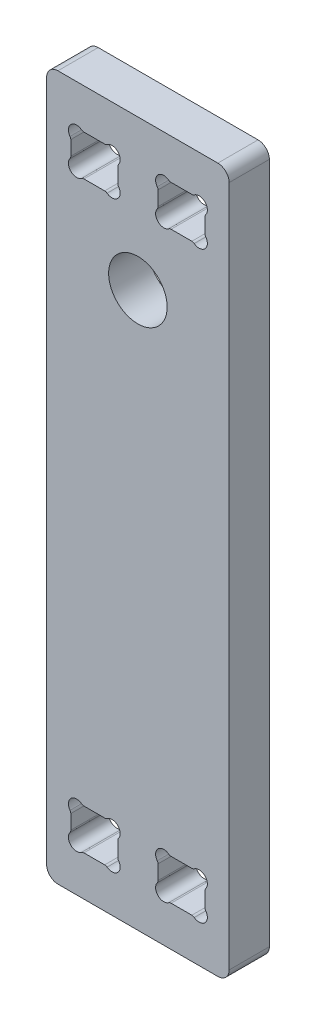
ISO-10303-21;
HEADER;
FILE_DESCRIPTION(('STEP AP214'),'2;1');
FILE_NAME('part.step','',(''),(''),'','','');
FILE_SCHEMA(('AUTOMOTIVE_DESIGN { 1 0 10303 214 1 1 1 1 }'));
ENDSEC;
DATA;
#1=APPLICATION_CONTEXT('core data for automotive mechanical design processes');
#2=APPLICATION_PROTOCOL_DEFINITION('international standard','automotive_design',2000,#1);
#3=PRODUCT_CONTEXT('',#1,'mechanical');
#4=PRODUCT('Part','Part','',(#3));
#5=PRODUCT_RELATED_PRODUCT_CATEGORY('part','',(#4));
#6=PRODUCT_DEFINITION_FORMATION('','',#4);
#7=PRODUCT_DEFINITION_CONTEXT('part definition',#1,'design');
#8=PRODUCT_DEFINITION('design','',#6,#7);
#9=PRODUCT_DEFINITION_SHAPE('','',#8);
#10=(LENGTH_UNIT() NAMED_UNIT(*) SI_UNIT(.MILLI.,.METRE.));
#11=(NAMED_UNIT(*) PLANE_ANGLE_UNIT() SI_UNIT($,.RADIAN.));
#12=(NAMED_UNIT(*) SI_UNIT($,.STERADIAN.) SOLID_ANGLE_UNIT());
#13=UNCERTAINTY_MEASURE_WITH_UNIT(LENGTH_MEASURE(1.E-05),#10,'distance_accuracy_value','');
#14=(GEOMETRIC_REPRESENTATION_CONTEXT(3) GLOBAL_UNCERTAINTY_ASSIGNED_CONTEXT((#13)) GLOBAL_UNIT_ASSIGNED_CONTEXT((#10,
#11,#12)) REPRESENTATION_CONTEXT('',''));
#15=CARTESIAN_POINT('',(0.,0.,0.));
#16=DIRECTION('',(0.,0.,1.));
#17=DIRECTION('',(1.,0.,0.));
#18=AXIS2_PLACEMENT_3D('',#15,#16,#17);
#19=CARTESIAN_POINT('',(56.6666666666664,125.60603170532,25.));
#20=DIRECTION('',(0.,0.,1.));
#21=DIRECTION('',(1.,0.,0.));
#22=AXIS2_PLACEMENT_3D('',#19,#20,#21);
#23=PLANE('',#22);
#24=CARTESIAN_POINT('',(56.6666666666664,125.60603170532,25.));
#25=DIRECTION('',(0.,0.,-1.));
#26=DIRECTION('',(1.,0.,0.));
#27=AXIS2_PLACEMENT_3D('',#24,#25,#26);
#28=CIRCLE('',#27,18.1776695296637);
#29=CARTESIAN_POINT('',(74.8443361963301,125.60603170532,25.));
#30=VERTEX_POINT('',#29);
#31=EDGE_CURVE('E1012',#30,#30,#28,.T.);
#32=ORIENTED_EDGE('',*,*,#31,.T.);
#33=EDGE_LOOP('',(#32));
#34=FACE_BOUND('',#33,.T.);
#35=DIRECTION('',(0.,-1.,0.));
#36=VECTOR('',#35,1.);
#37=CARTESIAN_POINT('',(0.,218.783701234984,25.));
#38=LINE('',#37,#36);
#39=CARTESIAN_POINT('',(0.,211.783701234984,25.));
#40=VERTEX_POINT('',#39);
#41=CARTESIAN_POINT('',(0.,-211.783701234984,25.));
#42=VERTEX_POINT('',#41);
#43=EDGE_CURVE('E1007',#40,#42,#38,.T.);
#44=ORIENTED_EDGE('',*,*,#43,.T.);
#45=CARTESIAN_POINT('',(7.00000000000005,-211.783701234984,25.));
#46=DIRECTION('',(0.,0.,1.));
#47=DIRECTION('',(1.,0.,0.));
#48=AXIS2_PLACEMENT_3D('',#45,#46,#47);
#49=CIRCLE('',#48,7.);
#50=CARTESIAN_POINT('',(7.00000000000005,-218.783701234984,25.));
#51=VERTEX_POINT('',#50);
#52=EDGE_CURVE('E41',#42,#51,#49,.T.);
#53=ORIENTED_EDGE('',*,*,#52,.T.);
#54=DIRECTION('',(1.,0.,0.));
#55=VECTOR('',#54,1.);
#56=CARTESIAN_POINT('',(0.,-218.783701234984,25.));
#57=LINE('',#56,#55);
#58=CARTESIAN_POINT('',(106.333333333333,-218.783701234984,25.));
#59=VERTEX_POINT('',#58);
#60=EDGE_CURVE('E1009',#51,#59,#57,.T.);
#61=ORIENTED_EDGE('',*,*,#60,.T.);
#62=CARTESIAN_POINT('',(106.333333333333,-211.783701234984,25.));
#63=DIRECTION('',(0.,0.,-1.));
#64=DIRECTION('',(-1.,0.,0.));
#65=AXIS2_PLACEMENT_3D('',#62,#63,#64);
#66=CIRCLE('',#65,7.);
#67=CARTESIAN_POINT('',(113.333333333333,-211.783701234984,25.));
#68=VERTEX_POINT('',#67);
#69=EDGE_CURVE('E770',#68,#59,#66,.T.);
#70=ORIENTED_EDGE('',*,*,#69,.F.);
#71=DIRECTION('',(0.,-1.,0.));
#72=VECTOR('',#71,1.);
#73=CARTESIAN_POINT('',(113.333333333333,218.783701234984,25.));
#74=LINE('',#73,#72);
#75=CARTESIAN_POINT('',(113.333333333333,211.783701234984,25.));
#76=VERTEX_POINT('',#75);
#77=EDGE_CURVE('E749',#76,#68,#74,.T.);
#78=ORIENTED_EDGE('',*,*,#77,.F.);
#79=CARTESIAN_POINT('',(106.333333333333,211.783701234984,25.));
#80=DIRECTION('',(0.,0.,-1.));
#81=DIRECTION('',(-1.,0.,0.));
#82=AXIS2_PLACEMENT_3D('',#79,#80,#81);
#83=CIRCLE('',#82,7.);
#84=CARTESIAN_POINT('',(106.333333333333,218.783701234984,25.));
#85=VERTEX_POINT('',#84);
#86=EDGE_CURVE('E767',#85,#76,#83,.T.);
#87=ORIENTED_EDGE('',*,*,#86,.F.);
#88=DIRECTION('',(-1.,0.,0.));
#89=VECTOR('',#88,1.);
#90=CARTESIAN_POINT('',(56.6666666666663,218.783701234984,25.));
#91=LINE('',#90,#89);
#92=CARTESIAN_POINT('',(6.99999999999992,218.783701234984,25.));
#93=VERTEX_POINT('',#92);
#94=EDGE_CURVE('E1015',#85,#93,#91,.T.);
#95=ORIENTED_EDGE('',*,*,#94,.T.);
#96=CARTESIAN_POINT('',(6.99999999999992,211.783701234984,25.));
#97=DIRECTION('',(0.,0.,1.));
#98=DIRECTION('',(1.,0.,0.));
#99=AXIS2_PLACEMENT_3D('',#96,#97,#98);
#100=CIRCLE('',#99,7.);
#101=EDGE_CURVE('E1035',#93,#40,#100,.T.);
#102=ORIENTED_EDGE('',*,*,#101,.T.);
#103=EDGE_LOOP('',(#44,#53,#61,#70,#78,#87,#95,#102));
#104=FACE_BOUND('',#103,.T.);
#105=CARTESIAN_POINT('',(18.6062445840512,-172.289945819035,25.));
#106=DIRECTION('',(0.,0.,1.));
#107=DIRECTION('',(1.,0.,0.));
#108=AXIS2_PLACEMENT_3D('',#105,#106,#107);
#109=CIRCLE('',#108,5.1);
#110=CARTESIAN_POINT('',(21.6426207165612,-168.192334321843,25.));
#111=VERTEX_POINT('',#110);
#112=CARTESIAN_POINT('',(14.5086330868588,-175.326321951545,25.));
#113=VERTEX_POINT('',#112);
#114=EDGE_CURVE('E894',#111,#113,#109,.T.);
#115=ORIENTED_EDGE('',*,*,#114,.F.);
#116=CARTESIAN_POINT('',(23.1310403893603,-166.183701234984,25.));
#117=DIRECTION('',(0.,0.,-1.));
#118=DIRECTION('',(1.,0.,0.));
#119=AXIS2_PLACEMENT_3D('',#116,#117,#118);
#120=CIRCLE('',#119,2.50000000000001);
#121=CARTESIAN_POINT('',(23.1310403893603,-168.683701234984,25.));
#122=VERTEX_POINT('',#121);
#123=EDGE_CURVE('E892',#122,#111,#120,.T.);
#124=ORIENTED_EDGE('',*,*,#123,.F.);
#125=DIRECTION('',(-1.,0.,0.));
#126=VECTOR('',#125,1.);
#127=CARTESIAN_POINT('',(36.0356262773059,-168.683701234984,25.));
#128=LINE('',#127,#126);
#129=CARTESIAN_POINT('',(36.0356262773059,-168.683701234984,25.));
#130=VERTEX_POINT('',#129);
#131=EDGE_CURVE('E924',#130,#122,#128,.T.);
#132=ORIENTED_EDGE('',*,*,#131,.F.);
#133=CARTESIAN_POINT('',(36.0356262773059,-166.183701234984,25.));
#134=DIRECTION('',(0.,0.,-1.));
#135=DIRECTION('',(-1.,0.,0.));
#136=AXIS2_PLACEMENT_3D('',#133,#134,#135);
#137=CIRCLE('',#136,2.50000000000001);
#138=CARTESIAN_POINT('',(37.524045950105,-168.192334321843,25.));
#139=VERTEX_POINT('',#138);
#140=EDGE_CURVE('E921',#139,#130,#137,.T.);
#141=ORIENTED_EDGE('',*,*,#140,.F.);
#142=CARTESIAN_POINT('',(40.5604220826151,-172.289945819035,25.));
#143=DIRECTION('',(0.,0.,1.));
#144=DIRECTION('',(-1.,0.,0.));
#145=AXIS2_PLACEMENT_3D('',#142,#143,#144);
#146=CIRCLE('',#145,5.1);
#147=CARTESIAN_POINT('',(44.6580335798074,-175.326321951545,25.));
#148=VERTEX_POINT('',#147);
#149=EDGE_CURVE('E919',#148,#139,#146,.T.);
#150=ORIENTED_EDGE('',*,*,#149,.F.);
#151=CARTESIAN_POINT('',(46.6666666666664,-176.814741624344,25.));
#152=DIRECTION('',(0.,0.,-1.));
#153=DIRECTION('',(1.,0.,0.));
#154=AXIS2_PLACEMENT_3D('',#151,#152,#153);
#155=CIRCLE('',#154,2.5);
#156=CARTESIAN_POINT('',(44.1666666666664,-176.814741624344,25.));
#157=VERTEX_POINT('',#156);
#158=EDGE_CURVE('E917',#157,#148,#155,.T.);
#159=ORIENTED_EDGE('',*,*,#158,.F.);
#160=DIRECTION('',(0.,1.,0.));
#161=VECTOR('',#160,1.);
#162=CARTESIAN_POINT('',(44.1666666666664,-176.814741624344,25.));
#163=LINE('',#162,#161);
#164=CARTESIAN_POINT('',(44.1666666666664,-185.752660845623,25.));
#165=VERTEX_POINT('',#164);
#166=EDGE_CURVE('E915',#165,#157,#163,.T.);
#167=ORIENTED_EDGE('',*,*,#166,.F.);
#168=CARTESIAN_POINT('',(46.6666666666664,-185.752660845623,25.));
#169=DIRECTION('',(0.,0.,-1.));
#170=DIRECTION('',(-1.,0.,0.));
#171=AXIS2_PLACEMENT_3D('',#168,#169,#170);
#172=CIRCLE('',#171,2.5);
#173=CARTESIAN_POINT('',(44.6580335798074,-187.241080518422,25.));
#174=VERTEX_POINT('',#173);
#175=EDGE_CURVE('E913',#174,#165,#172,.T.);
#176=ORIENTED_EDGE('',*,*,#175,.F.);
#177=CARTESIAN_POINT('',(40.5604220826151,-190.277456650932,25.));
#178=DIRECTION('',(0.,0.,1.));
#179=DIRECTION('',(1.,0.,0.));
#180=AXIS2_PLACEMENT_3D('',#177,#178,#179);
#181=CIRCLE('',#180,5.1);
#182=CARTESIAN_POINT('',(37.524045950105,-194.375068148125,25.));
#183=VERTEX_POINT('',#182);
#184=EDGE_CURVE('E911',#183,#174,#181,.T.);
#185=ORIENTED_EDGE('',*,*,#184,.F.);
#186=CARTESIAN_POINT('',(36.0356262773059,-196.383701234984,25.));
#187=DIRECTION('',(0.,0.,-1.));
#188=DIRECTION('',(1.,0.,0.));
#189=AXIS2_PLACEMENT_3D('',#186,#187,#188);
#190=CIRCLE('',#189,2.50000000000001);
#191=CARTESIAN_POINT('',(36.0356262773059,-193.883701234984,25.));
#192=VERTEX_POINT('',#191);
#193=EDGE_CURVE('E909',#192,#183,#190,.T.);
#194=ORIENTED_EDGE('',*,*,#193,.F.);
#195=DIRECTION('',(1.,0.,0.));
#196=VECTOR('',#195,1.);
#197=CARTESIAN_POINT('',(36.0356262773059,-193.883701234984,25.));
#198=LINE('',#197,#196);
#199=CARTESIAN_POINT('',(23.1310403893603,-193.883701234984,25.));
#200=VERTEX_POINT('',#199);
#201=EDGE_CURVE('E907',#200,#192,#198,.T.);
#202=ORIENTED_EDGE('',*,*,#201,.F.);
#203=CARTESIAN_POINT('',(23.1310403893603,-196.383701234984,25.));
#204=DIRECTION('',(0.,0.,-1.));
#205=DIRECTION('',(-1.,0.,0.));
#206=AXIS2_PLACEMENT_3D('',#203,#204,#205);
#207=CIRCLE('',#206,2.50000000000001);
#208=CARTESIAN_POINT('',(21.6426207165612,-194.375068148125,25.));
#209=VERTEX_POINT('',#208);
#210=EDGE_CURVE('E905',#209,#200,#207,.T.);
#211=ORIENTED_EDGE('',*,*,#210,.F.);
#212=CARTESIAN_POINT('',(18.6062445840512,-190.277456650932,25.));
#213=DIRECTION('',(0.,0.,1.));
#214=DIRECTION('',(-1.,0.,0.));
#215=AXIS2_PLACEMENT_3D('',#212,#213,#214);
#216=CIRCLE('',#215,5.1);
#217=CARTESIAN_POINT('',(14.5086330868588,-187.241080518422,25.));
#218=VERTEX_POINT('',#217);
#219=EDGE_CURVE('E903',#218,#209,#216,.T.);
#220=ORIENTED_EDGE('',*,*,#219,.F.);
#221=CARTESIAN_POINT('',(12.4999999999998,-185.752660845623,25.));
#222=DIRECTION('',(0.,0.,-1.));
#223=DIRECTION('',(1.,0.,0.));
#224=AXIS2_PLACEMENT_3D('',#221,#222,#223);
#225=CIRCLE('',#224,2.5);
#226=CARTESIAN_POINT('',(14.9999999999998,-185.752660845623,25.));
#227=VERTEX_POINT('',#226);
#228=EDGE_CURVE('E901',#227,#218,#225,.T.);
#229=ORIENTED_EDGE('',*,*,#228,.F.);
#230=DIRECTION('',(0.,-1.,0.));
#231=VECTOR('',#230,1.);
#232=CARTESIAN_POINT('',(14.9999999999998,-176.814741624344,25.));
#233=LINE('',#232,#231);
#234=CARTESIAN_POINT('',(14.9999999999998,-176.814741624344,25.));
#235=VERTEX_POINT('',#234);
#236=EDGE_CURVE('E899',#235,#227,#233,.T.);
#237=ORIENTED_EDGE('',*,*,#236,.F.);
#238=CARTESIAN_POINT('',(12.4999999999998,-176.814741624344,25.));
#239=DIRECTION('',(0.,0.,-1.));
#240=DIRECTION('',(-1.,0.,0.));
#241=AXIS2_PLACEMENT_3D('',#238,#239,#240);
#242=CIRCLE('',#241,2.5);
#243=EDGE_CURVE('E897',#113,#235,#242,.T.);
#244=ORIENTED_EDGE('',*,*,#243,.F.);
#245=EDGE_LOOP('',(#115,#124,#132,#141,#150,#159,#167,#176,#185,#194,#202,#211,#220,#229,#237,#244));
#246=FACE_BOUND('',#245,.T.);
#247=CARTESIAN_POINT('',(36.0356262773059,196.383701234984,25.));
#248=DIRECTION('',(0.,0.,-1.));
#249=DIRECTION('',(-1.,0.,0.));
#250=AXIS2_PLACEMENT_3D('',#247,#248,#249);
#251=CIRCLE('',#250,2.50000000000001);
#252=CARTESIAN_POINT('',(37.5240459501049,194.375068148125,25.));
#253=VERTEX_POINT('',#252);
#254=CARTESIAN_POINT('',(36.0356262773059,193.883701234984,25.));
#255=VERTEX_POINT('',#254);
#256=EDGE_CURVE('E779',#253,#255,#251,.T.);
#257=ORIENTED_EDGE('',*,*,#256,.F.);
#258=CARTESIAN_POINT('',(40.560422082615,190.277456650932,25.));
#259=DIRECTION('',(0.,0.,1.));
#260=DIRECTION('',(-1.,0.,0.));
#261=AXIS2_PLACEMENT_3D('',#258,#259,#260);
#262=CIRCLE('',#261,5.1);
#263=CARTESIAN_POINT('',(44.6580335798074,187.241080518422,25.));
#264=VERTEX_POINT('',#263);
#265=EDGE_CURVE('E777',#264,#253,#262,.T.);
#266=ORIENTED_EDGE('',*,*,#265,.F.);
#267=CARTESIAN_POINT('',(46.6666666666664,185.752660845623,25.));
#268=DIRECTION('',(0.,0.,-1.));
#269=DIRECTION('',(1.,0.,0.));
#270=AXIS2_PLACEMENT_3D('',#267,#268,#269);
#271=CIRCLE('',#270,2.5);
#272=CARTESIAN_POINT('',(44.1666666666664,185.752660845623,25.));
#273=VERTEX_POINT('',#272);
#274=EDGE_CURVE('E809',#273,#264,#271,.T.);
#275=ORIENTED_EDGE('',*,*,#274,.F.);
#276=DIRECTION('',(0.,1.,0.));
#277=VECTOR('',#276,1.);
#278=CARTESIAN_POINT('',(44.1666666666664,176.814741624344,25.));
#279=LINE('',#278,#277);
#280=CARTESIAN_POINT('',(44.1666666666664,176.814741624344,25.));
#281=VERTEX_POINT('',#280);
#282=EDGE_CURVE('E806',#281,#273,#279,.T.);
#283=ORIENTED_EDGE('',*,*,#282,.F.);
#284=CARTESIAN_POINT('',(46.6666666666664,176.814741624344,25.));
#285=DIRECTION('',(0.,0.,-1.));
#286=DIRECTION('',(-1.,0.,0.));
#287=AXIS2_PLACEMENT_3D('',#284,#285,#286);
#288=CIRCLE('',#287,2.5);
#289=CARTESIAN_POINT('',(44.6580335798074,175.326321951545,25.));
#290=VERTEX_POINT('',#289);
#291=EDGE_CURVE('E804',#290,#281,#288,.T.);
#292=ORIENTED_EDGE('',*,*,#291,.F.);
#293=CARTESIAN_POINT('',(40.560422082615,172.289945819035,25.));
#294=DIRECTION('',(0.,0.,1.));
#295=DIRECTION('',(1.,0.,0.));
#296=AXIS2_PLACEMENT_3D('',#293,#294,#295);
#297=CIRCLE('',#296,5.1);
#298=CARTESIAN_POINT('',(37.5240459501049,168.192334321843,25.));
#299=VERTEX_POINT('',#298);
#300=EDGE_CURVE('E802',#299,#290,#297,.T.);
#301=ORIENTED_EDGE('',*,*,#300,.F.);
#302=CARTESIAN_POINT('',(36.0356262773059,166.183701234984,25.));
#303=DIRECTION('',(0.,0.,-1.));
#304=DIRECTION('',(1.,0.,0.));
#305=AXIS2_PLACEMENT_3D('',#302,#303,#304);
#306=CIRCLE('',#305,2.50000000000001);
#307=CARTESIAN_POINT('',(36.0356262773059,168.683701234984,25.));
#308=VERTEX_POINT('',#307);
#309=EDGE_CURVE('E800',#308,#299,#306,.T.);
#310=ORIENTED_EDGE('',*,*,#309,.F.);
#311=DIRECTION('',(1.,0.,0.));
#312=VECTOR('',#311,1.);
#313=CARTESIAN_POINT('',(36.0356262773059,168.683701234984,25.));
#314=LINE('',#313,#312);
#315=CARTESIAN_POINT('',(23.1310403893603,168.683701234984,25.));
#316=VERTEX_POINT('',#315);
#317=EDGE_CURVE('E798',#316,#308,#314,.T.);
#318=ORIENTED_EDGE('',*,*,#317,.F.);
#319=CARTESIAN_POINT('',(23.1310403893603,166.183701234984,25.));
#320=DIRECTION('',(0.,0.,-1.));
#321=DIRECTION('',(-1.,0.,0.));
#322=AXIS2_PLACEMENT_3D('',#319,#320,#321);
#323=CIRCLE('',#322,2.50000000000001);
#324=CARTESIAN_POINT('',(21.6426207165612,168.192334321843,25.));
#325=VERTEX_POINT('',#324);
#326=EDGE_CURVE('E796',#325,#316,#323,.T.);
#327=ORIENTED_EDGE('',*,*,#326,.F.);
#328=CARTESIAN_POINT('',(18.6062445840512,172.289945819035,25.));
#329=DIRECTION('',(0.,0.,1.));
#330=DIRECTION('',(-1.,0.,0.));
#331=AXIS2_PLACEMENT_3D('',#328,#329,#330);
#332=CIRCLE('',#331,5.1);
#333=CARTESIAN_POINT('',(14.5086330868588,175.326321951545,25.));
#334=VERTEX_POINT('',#333);
#335=EDGE_CURVE('E794',#334,#325,#332,.T.);
#336=ORIENTED_EDGE('',*,*,#335,.F.);
#337=CARTESIAN_POINT('',(12.4999999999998,176.814741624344,25.));
#338=DIRECTION('',(0.,0.,-1.));
#339=DIRECTION('',(1.,0.,0.));
#340=AXIS2_PLACEMENT_3D('',#337,#338,#339);
#341=CIRCLE('',#340,2.5);
#342=CARTESIAN_POINT('',(14.9999999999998,176.814741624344,25.));
#343=VERTEX_POINT('',#342);
#344=EDGE_CURVE('E792',#343,#334,#341,.T.);
#345=ORIENTED_EDGE('',*,*,#344,.F.);
#346=DIRECTION('',(0.,-1.,0.));
#347=VECTOR('',#346,1.);
#348=CARTESIAN_POINT('',(14.9999999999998,176.814741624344,25.));
#349=LINE('',#348,#347);
#350=CARTESIAN_POINT('',(14.9999999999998,185.752660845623,25.));
#351=VERTEX_POINT('',#350);
#352=EDGE_CURVE('E790',#351,#343,#349,.T.);
#353=ORIENTED_EDGE('',*,*,#352,.F.);
#354=CARTESIAN_POINT('',(12.4999999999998,185.752660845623,25.));
#355=DIRECTION('',(0.,0.,-1.));
#356=DIRECTION('',(-1.,0.,0.));
#357=AXIS2_PLACEMENT_3D('',#354,#355,#356);
#358=CIRCLE('',#357,2.5);
#359=CARTESIAN_POINT('',(14.5086330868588,187.241080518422,25.));
#360=VERTEX_POINT('',#359);
#361=EDGE_CURVE('E788',#360,#351,#358,.T.);
#362=ORIENTED_EDGE('',*,*,#361,.F.);
#363=CARTESIAN_POINT('',(18.6062445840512,190.277456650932,25.));
#364=DIRECTION('',(0.,0.,1.));
#365=DIRECTION('',(1.,0.,0.));
#366=AXIS2_PLACEMENT_3D('',#363,#364,#365);
#367=CIRCLE('',#366,5.1);
#368=CARTESIAN_POINT('',(21.6426207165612,194.375068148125,25.));
#369=VERTEX_POINT('',#368);
#370=EDGE_CURVE('E786',#369,#360,#367,.T.);
#371=ORIENTED_EDGE('',*,*,#370,.F.);
#372=CARTESIAN_POINT('',(23.1310403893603,196.383701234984,25.));
#373=DIRECTION('',(0.,0.,-1.));
#374=DIRECTION('',(1.,0.,0.));
#375=AXIS2_PLACEMENT_3D('',#372,#373,#374);
#376=CIRCLE('',#375,2.50000000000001);
#377=CARTESIAN_POINT('',(23.1310403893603,193.883701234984,25.));
#378=VERTEX_POINT('',#377);
#379=EDGE_CURVE('E784',#378,#369,#376,.T.);
#380=ORIENTED_EDGE('',*,*,#379,.F.);
#381=DIRECTION('',(-1.,0.,0.));
#382=VECTOR('',#381,1.);
#383=CARTESIAN_POINT('',(36.0356262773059,193.883701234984,25.));
#384=LINE('',#383,#382);
#385=EDGE_CURVE('E782',#255,#378,#384,.T.);
#386=ORIENTED_EDGE('',*,*,#385,.F.);
#387=EDGE_LOOP('',(#257,#266,#275,#283,#292,#301,#310,#318,#327,#336,#345,#353,#362,#371,#380,#386));
#388=FACE_BOUND('',#387,.T.);
#389=CARTESIAN_POINT('',(94.7270887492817,-172.289945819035,25.));
#390=DIRECTION('',(0.,0.,-1.));
#391=DIRECTION('',(-1.,0.,0.));
#392=AXIS2_PLACEMENT_3D('',#389,#390,#391);
#393=CIRCLE('',#392,5.1);
#394=CARTESIAN_POINT('',(91.6907126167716,-168.192334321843,25.));
#395=VERTEX_POINT('',#394);
#396=CARTESIAN_POINT('',(98.8247002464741,-175.326321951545,25.));
#397=VERTEX_POINT('',#396);
#398=EDGE_CURVE('E624',#395,#397,#393,.T.);
#399=ORIENTED_EDGE('',*,*,#398,.T.);
#400=CARTESIAN_POINT('',(100.833333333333,-176.814741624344,25.));
#401=DIRECTION('',(0.,0.,1.));
#402=DIRECTION('',(1.,0.,0.));
#403=AXIS2_PLACEMENT_3D('',#400,#401,#402);
#404=CIRCLE('',#403,2.5);
#405=CARTESIAN_POINT('',(98.3333333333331,-176.814741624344,25.));
#406=VERTEX_POINT('',#405);
#407=EDGE_CURVE('E628',#397,#406,#404,.T.);
#408=ORIENTED_EDGE('',*,*,#407,.T.);
#409=DIRECTION('',(0.,-1.,0.));
#410=VECTOR('',#409,1.);
#411=CARTESIAN_POINT('',(98.3333333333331,-176.814741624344,25.));
#412=LINE('',#411,#410);
#413=CARTESIAN_POINT('',(98.3333333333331,-185.752660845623,25.));
#414=VERTEX_POINT('',#413);
#415=EDGE_CURVE('E631',#406,#414,#412,.T.);
#416=ORIENTED_EDGE('',*,*,#415,.T.);
#417=CARTESIAN_POINT('',(100.833333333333,-185.752660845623,25.));
#418=DIRECTION('',(0.,0.,1.));
#419=DIRECTION('',(-1.,0.,0.));
#420=AXIS2_PLACEMENT_3D('',#417,#418,#419);
#421=CIRCLE('',#420,2.5);
#422=CARTESIAN_POINT('',(98.8247002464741,-187.241080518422,25.));
#423=VERTEX_POINT('',#422);
#424=EDGE_CURVE('E634',#414,#423,#421,.T.);
#425=ORIENTED_EDGE('',*,*,#424,.T.);
#426=CARTESIAN_POINT('',(94.7270887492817,-190.277456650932,25.));
#427=DIRECTION('',(0.,0.,-1.));
#428=DIRECTION('',(1.,0.,0.));
#429=AXIS2_PLACEMENT_3D('',#426,#427,#428);
#430=CIRCLE('',#429,5.1);
#431=CARTESIAN_POINT('',(91.6907126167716,-194.375068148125,25.));
#432=VERTEX_POINT('',#431);
#433=EDGE_CURVE('E637',#423,#432,#430,.T.);
#434=ORIENTED_EDGE('',*,*,#433,.T.);
#435=CARTESIAN_POINT('',(90.2022929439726,-196.383701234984,25.));
#436=DIRECTION('',(0.,0.,1.));
#437=DIRECTION('',(1.,0.,0.));
#438=AXIS2_PLACEMENT_3D('',#435,#436,#437);
#439=CIRCLE('',#438,2.50000000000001);
#440=CARTESIAN_POINT('',(90.2022929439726,-193.883701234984,25.));
#441=VERTEX_POINT('',#440);
#442=EDGE_CURVE('E640',#432,#441,#439,.T.);
#443=ORIENTED_EDGE('',*,*,#442,.T.);
#444=DIRECTION('',(-1.,0.,0.));
#445=VECTOR('',#444,1.);
#446=CARTESIAN_POINT('',(77.297707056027,-193.883701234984,25.));
#447=LINE('',#446,#445);
#448=CARTESIAN_POINT('',(77.297707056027,-193.883701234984,25.));
#449=VERTEX_POINT('',#448);
#450=EDGE_CURVE('E643',#441,#449,#447,.T.);
#451=ORIENTED_EDGE('',*,*,#450,.T.);
#452=CARTESIAN_POINT('',(77.297707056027,-196.383701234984,25.));
#453=DIRECTION('',(0.,0.,1.));
#454=DIRECTION('',(-1.,0.,0.));
#455=AXIS2_PLACEMENT_3D('',#452,#453,#454);
#456=CIRCLE('',#455,2.50000000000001);
#457=CARTESIAN_POINT('',(75.8092873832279,-194.375068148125,25.));
#458=VERTEX_POINT('',#457);
#459=EDGE_CURVE('E646',#449,#458,#456,.T.);
#460=ORIENTED_EDGE('',*,*,#459,.T.);
#461=CARTESIAN_POINT('',(72.7729112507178,-190.277456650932,25.));
#462=DIRECTION('',(0.,0.,-1.));
#463=DIRECTION('',(-1.,0.,0.));
#464=AXIS2_PLACEMENT_3D('',#461,#462,#463);
#465=CIRCLE('',#464,5.1);
#466=CARTESIAN_POINT('',(68.6752997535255,-187.241080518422,25.));
#467=VERTEX_POINT('',#466);
#468=EDGE_CURVE('E649',#458,#467,#465,.T.);
#469=ORIENTED_EDGE('',*,*,#468,.T.);
#470=CARTESIAN_POINT('',(66.6666666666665,-185.752660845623,25.));
#471=DIRECTION('',(0.,0.,1.));
#472=DIRECTION('',(1.,0.,0.));
#473=AXIS2_PLACEMENT_3D('',#470,#471,#472);
#474=CIRCLE('',#473,2.5);
#475=CARTESIAN_POINT('',(69.1666666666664,-185.752660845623,25.));
#476=VERTEX_POINT('',#475);
#477=EDGE_CURVE('E652',#467,#476,#474,.T.);
#478=ORIENTED_EDGE('',*,*,#477,.T.);
#479=DIRECTION('',(0.,1.,0.));
#480=VECTOR('',#479,1.);
#481=CARTESIAN_POINT('',(69.1666666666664,-176.814741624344,25.));
#482=LINE('',#481,#480);
#483=CARTESIAN_POINT('',(69.1666666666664,-176.814741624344,25.));
#484=VERTEX_POINT('',#483);
#485=EDGE_CURVE('E655',#476,#484,#482,.T.);
#486=ORIENTED_EDGE('',*,*,#485,.T.);
#487=CARTESIAN_POINT('',(66.6666666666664,-176.814741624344,25.));
#488=DIRECTION('',(0.,0.,1.));
#489=DIRECTION('',(-1.,0.,0.));
#490=AXIS2_PLACEMENT_3D('',#487,#488,#489);
#491=CIRCLE('',#490,2.5);
#492=CARTESIAN_POINT('',(68.6752997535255,-175.326321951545,25.));
#493=VERTEX_POINT('',#492);
#494=EDGE_CURVE('E658',#484,#493,#491,.T.);
#495=ORIENTED_EDGE('',*,*,#494,.T.);
#496=CARTESIAN_POINT('',(72.7729112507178,-172.289945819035,25.));
#497=DIRECTION('',(0.,0.,-1.));
#498=DIRECTION('',(1.,0.,0.));
#499=AXIS2_PLACEMENT_3D('',#496,#497,#498);
#500=CIRCLE('',#499,5.1);
#501=CARTESIAN_POINT('',(75.8092873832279,-168.192334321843,25.));
#502=VERTEX_POINT('',#501);
#503=EDGE_CURVE('E661',#493,#502,#500,.T.);
#504=ORIENTED_EDGE('',*,*,#503,.T.);
#505=CARTESIAN_POINT('',(77.297707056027,-166.183701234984,25.));
#506=DIRECTION('',(0.,0.,1.));
#507=DIRECTION('',(1.,0.,0.));
#508=AXIS2_PLACEMENT_3D('',#505,#506,#507);
#509=CIRCLE('',#508,2.50000000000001);
#510=CARTESIAN_POINT('',(77.297707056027,-168.683701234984,25.));
#511=VERTEX_POINT('',#510);
#512=EDGE_CURVE('E664',#502,#511,#509,.T.);
#513=ORIENTED_EDGE('',*,*,#512,.T.);
#514=DIRECTION('',(1.,0.,0.));
#515=VECTOR('',#514,1.);
#516=CARTESIAN_POINT('',(77.297707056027,-168.683701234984,25.));
#517=LINE('',#516,#515);
#518=CARTESIAN_POINT('',(90.2022929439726,-168.683701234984,25.));
#519=VERTEX_POINT('',#518);
#520=EDGE_CURVE('E667',#511,#519,#517,.T.);
#521=ORIENTED_EDGE('',*,*,#520,.T.);
#522=CARTESIAN_POINT('',(90.2022929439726,-166.183701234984,25.));
#523=DIRECTION('',(0.,0.,1.));
#524=DIRECTION('',(-1.,0.,0.));
#525=AXIS2_PLACEMENT_3D('',#522,#523,#524);
#526=CIRCLE('',#525,2.50000000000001);
#527=EDGE_CURVE('E621',#519,#395,#526,.T.);
#528=ORIENTED_EDGE('',*,*,#527,.T.);
#529=EDGE_LOOP('',(#399,#408,#416,#425,#434,#443,#451,#460,#469,#478,#486,#495,#504,#513,#521,#528));
#530=FACE_BOUND('',#529,.T.);
#531=CARTESIAN_POINT('',(77.297707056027,196.383701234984,25.));
#532=DIRECTION('',(0.,0.,1.));
#533=DIRECTION('',(1.,0.,0.));
#534=AXIS2_PLACEMENT_3D('',#531,#532,#533);
#535=CIRCLE('',#534,2.50000000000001);
#536=CARTESIAN_POINT('',(75.8092873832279,194.375068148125,25.));
#537=VERTEX_POINT('',#536);
#538=CARTESIAN_POINT('',(77.297707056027,193.883701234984,25.));
#539=VERTEX_POINT('',#538);
#540=EDGE_CURVE('E500',#537,#539,#535,.T.);
#541=ORIENTED_EDGE('',*,*,#540,.T.);
#542=DIRECTION('',(1.,0.,0.));
#543=VECTOR('',#542,1.);
#544=CARTESIAN_POINT('',(77.297707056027,193.883701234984,25.));
#545=LINE('',#544,#543);
#546=CARTESIAN_POINT('',(90.2022929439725,193.883701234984,25.));
#547=VERTEX_POINT('',#546);
#548=EDGE_CURVE('E508',#539,#547,#545,.T.);
#549=ORIENTED_EDGE('',*,*,#548,.T.);
#550=CARTESIAN_POINT('',(90.2022929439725,196.383701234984,25.));
#551=DIRECTION('',(0.,0.,1.));
#552=DIRECTION('',(-1.,0.,0.));
#553=AXIS2_PLACEMENT_3D('',#550,#551,#552);
#554=CIRCLE('',#553,2.50000000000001);
#555=CARTESIAN_POINT('',(91.6907126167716,194.375068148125,25.));
#556=VERTEX_POINT('',#555);
#557=EDGE_CURVE('E510',#547,#556,#554,.T.);
#558=ORIENTED_EDGE('',*,*,#557,.T.);
#559=CARTESIAN_POINT('',(94.7270887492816,190.277456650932,25.));
#560=DIRECTION('',(0.,0.,-1.));
#561=DIRECTION('',(-1.,0.,0.));
#562=AXIS2_PLACEMENT_3D('',#559,#560,#561);
#563=CIRCLE('',#562,5.1);
#564=CARTESIAN_POINT('',(98.824700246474,187.241080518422,25.));
#565=VERTEX_POINT('',#564);
#566=EDGE_CURVE('E515',#556,#565,#563,.T.);
#567=ORIENTED_EDGE('',*,*,#566,.T.);
#568=CARTESIAN_POINT('',(100.833333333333,185.752660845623,25.));
#569=DIRECTION('',(0.,0.,1.));
#570=DIRECTION('',(1.,0.,0.));
#571=AXIS2_PLACEMENT_3D('',#568,#569,#570);
#572=CIRCLE('',#571,2.5);
#573=CARTESIAN_POINT('',(98.333333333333,185.752660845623,25.));
#574=VERTEX_POINT('',#573);
#575=EDGE_CURVE('E518',#565,#574,#572,.T.);
#576=ORIENTED_EDGE('',*,*,#575,.T.);
#577=DIRECTION('',(0.,-1.,0.));
#578=VECTOR('',#577,1.);
#579=CARTESIAN_POINT('',(98.333333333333,176.814741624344,25.));
#580=LINE('',#579,#578);
#581=CARTESIAN_POINT('',(98.333333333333,176.814741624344,25.));
#582=VERTEX_POINT('',#581);
#583=EDGE_CURVE('E521',#574,#582,#580,.T.);
#584=ORIENTED_EDGE('',*,*,#583,.T.);
#585=CARTESIAN_POINT('',(100.833333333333,176.814741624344,25.));
#586=DIRECTION('',(0.,0.,1.));
#587=DIRECTION('',(-1.,0.,0.));
#588=AXIS2_PLACEMENT_3D('',#585,#586,#587);
#589=CIRCLE('',#588,2.5);
#590=CARTESIAN_POINT('',(98.824700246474,175.326321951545,25.));
#591=VERTEX_POINT('',#590);
#592=EDGE_CURVE('E524',#582,#591,#589,.T.);
#593=ORIENTED_EDGE('',*,*,#592,.T.);
#594=CARTESIAN_POINT('',(94.7270887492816,172.289945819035,25.));
#595=DIRECTION('',(0.,0.,-1.));
#596=DIRECTION('',(1.,0.,0.));
#597=AXIS2_PLACEMENT_3D('',#594,#595,#596);
#598=CIRCLE('',#597,5.1);
#599=CARTESIAN_POINT('',(91.6907126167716,168.192334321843,25.));
#600=VERTEX_POINT('',#599);
#601=EDGE_CURVE('E527',#591,#600,#598,.T.);
#602=ORIENTED_EDGE('',*,*,#601,.T.);
#603=CARTESIAN_POINT('',(90.2022929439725,166.183701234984,25.));
#604=DIRECTION('',(0.,0.,1.));
#605=DIRECTION('',(1.,0.,0.));
#606=AXIS2_PLACEMENT_3D('',#603,#604,#605);
#607=CIRCLE('',#606,2.50000000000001);
#608=CARTESIAN_POINT('',(90.2022929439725,168.683701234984,25.));
#609=VERTEX_POINT('',#608);
#610=EDGE_CURVE('E530',#600,#609,#607,.T.);
#611=ORIENTED_EDGE('',*,*,#610,.T.);
#612=DIRECTION('',(-1.,0.,0.));
#613=VECTOR('',#612,1.);
#614=CARTESIAN_POINT('',(77.297707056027,168.683701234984,25.));
#615=LINE('',#614,#613);
#616=CARTESIAN_POINT('',(77.297707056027,168.683701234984,25.));
#617=VERTEX_POINT('',#616);
#618=EDGE_CURVE('E533',#609,#617,#615,.T.);
#619=ORIENTED_EDGE('',*,*,#618,.T.);
#620=CARTESIAN_POINT('',(77.297707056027,166.183701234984,25.));
#621=DIRECTION('',(0.,0.,1.));
#622=DIRECTION('',(-1.,0.,0.));
#623=AXIS2_PLACEMENT_3D('',#620,#621,#622);
#624=CIRCLE('',#623,2.50000000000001);
#625=CARTESIAN_POINT('',(75.8092873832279,168.192334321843,25.));
#626=VERTEX_POINT('',#625);
#627=EDGE_CURVE('E536',#617,#626,#624,.T.);
#628=ORIENTED_EDGE('',*,*,#627,.T.);
#629=CARTESIAN_POINT('',(72.7729112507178,172.289945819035,25.));
#630=DIRECTION('',(0.,0.,-1.));
#631=DIRECTION('',(-1.,0.,0.));
#632=AXIS2_PLACEMENT_3D('',#629,#630,#631);
#633=CIRCLE('',#632,5.1);
#634=CARTESIAN_POINT('',(68.6752997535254,175.326321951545,25.));
#635=VERTEX_POINT('',#634);
#636=EDGE_CURVE('E539',#626,#635,#633,.T.);
#637=ORIENTED_EDGE('',*,*,#636,.T.);
#638=CARTESIAN_POINT('',(66.6666666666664,176.814741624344,25.));
#639=DIRECTION('',(0.,0.,1.));
#640=DIRECTION('',(1.,0.,0.));
#641=AXIS2_PLACEMENT_3D('',#638,#639,#640);
#642=CIRCLE('',#641,2.5);
#643=CARTESIAN_POINT('',(69.1666666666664,176.814741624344,25.));
#644=VERTEX_POINT('',#643);
#645=EDGE_CURVE('E542',#635,#644,#642,.T.);
#646=ORIENTED_EDGE('',*,*,#645,.T.);
#647=DIRECTION('',(0.,1.,0.));
#648=VECTOR('',#647,1.);
#649=CARTESIAN_POINT('',(69.1666666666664,176.814741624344,25.));
#650=LINE('',#649,#648);
#651=CARTESIAN_POINT('',(69.1666666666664,185.752660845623,25.));
#652=VERTEX_POINT('',#651);
#653=EDGE_CURVE('E545',#644,#652,#650,.T.);
#654=ORIENTED_EDGE('',*,*,#653,.T.);
#655=CARTESIAN_POINT('',(66.6666666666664,185.752660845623,25.));
#656=DIRECTION('',(0.,0.,1.));
#657=DIRECTION('',(-1.,0.,0.));
#658=AXIS2_PLACEMENT_3D('',#655,#656,#657);
#659=CIRCLE('',#658,2.5);
#660=CARTESIAN_POINT('',(68.6752997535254,187.241080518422,25.));
#661=VERTEX_POINT('',#660);
#662=EDGE_CURVE('E503',#652,#661,#659,.T.);
#663=ORIENTED_EDGE('',*,*,#662,.T.);
#664=CARTESIAN_POINT('',(72.7729112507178,190.277456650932,25.));
#665=DIRECTION('',(0.,0.,-1.));
#666=DIRECTION('',(1.,0.,0.));
#667=AXIS2_PLACEMENT_3D('',#664,#665,#666);
#668=CIRCLE('',#667,5.1);
#669=EDGE_CURVE('E486',#661,#537,#668,.T.);
#670=ORIENTED_EDGE('',*,*,#669,.T.);
#671=EDGE_LOOP('',(#541,#549,#558,#567,#576,#584,#593,#602,#611,#619,#628,#637,#646,#654,#663,#670));
#672=FACE_BOUND('',#671,.T.);
#673=ADVANCED_FACE('F33',(#34,#104,#246,#388,#530,#672),#23,.T.);
#674=CARTESIAN_POINT('',(56.6666666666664,125.60603170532,0.));
#675=DIRECTION('',(0.,0.,1.));
#676=DIRECTION('',(1.,0.,0.));
#677=AXIS2_PLACEMENT_3D('',#674,#675,#676);
#678=PLANE('',#677);
#679=CARTESIAN_POINT('',(56.6666666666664,125.60603170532,0.));
#680=DIRECTION('',(0.,0.,-1.));
#681=DIRECTION('',(1.,0.,0.));
#682=AXIS2_PLACEMENT_3D('',#679,#680,#681);
#683=CIRCLE('',#682,18.1776695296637);
#684=CARTESIAN_POINT('',(74.8443361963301,125.60603170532,0.));
#685=VERTEX_POINT('',#684);
#686=EDGE_CURVE('E1021',#685,#685,#683,.T.);
#687=ORIENTED_EDGE('',*,*,#686,.F.);
#688=EDGE_LOOP('',(#687));
#689=FACE_BOUND('',#688,.T.);
#690=CARTESIAN_POINT('',(23.1310403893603,-166.183701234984,0.));
#691=DIRECTION('',(0.,0.,-1.));
#692=DIRECTION('',(1.,0.,0.));
#693=AXIS2_PLACEMENT_3D('',#690,#691,#692);
#694=CIRCLE('',#693,2.50000000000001);
#695=CARTESIAN_POINT('',(23.1310403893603,-168.683701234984,0.));
#696=VERTEX_POINT('',#695);
#697=CARTESIAN_POINT('',(21.6426207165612,-168.192334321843,0.));
#698=VERTEX_POINT('',#697);
#699=EDGE_CURVE('E891',#696,#698,#694,.T.);
#700=ORIENTED_EDGE('',*,*,#699,.T.);
#701=CARTESIAN_POINT('',(18.6062445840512,-172.289945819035,0.));
#702=DIRECTION('',(0.,0.,1.));
#703=DIRECTION('',(1.,0.,0.));
#704=AXIS2_PLACEMENT_3D('',#701,#702,#703);
#705=CIRCLE('',#704,5.1);
#706=CARTESIAN_POINT('',(14.5086330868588,-175.326321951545,0.));
#707=VERTEX_POINT('',#706);
#708=EDGE_CURVE('E929',#698,#707,#705,.T.);
#709=ORIENTED_EDGE('',*,*,#708,.T.);
#710=CARTESIAN_POINT('',(12.4999999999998,-176.814741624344,0.));
#711=DIRECTION('',(0.,0.,-1.));
#712=DIRECTION('',(-1.,0.,0.));
#713=AXIS2_PLACEMENT_3D('',#710,#711,#712);
#714=CIRCLE('',#713,2.5);
#715=CARTESIAN_POINT('',(14.9999999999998,-176.814741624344,0.));
#716=VERTEX_POINT('',#715);
#717=EDGE_CURVE('E932',#707,#716,#714,.T.);
#718=ORIENTED_EDGE('',*,*,#717,.T.);
#719=DIRECTION('',(0.,-1.,0.));
#720=VECTOR('',#719,1.);
#721=CARTESIAN_POINT('',(14.9999999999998,-176.814741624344,0.));
#722=LINE('',#721,#720);
#723=CARTESIAN_POINT('',(14.9999999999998,-185.752660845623,0.));
#724=VERTEX_POINT('',#723);
#725=EDGE_CURVE('E935',#716,#724,#722,.T.);
#726=ORIENTED_EDGE('',*,*,#725,.T.);
#727=CARTESIAN_POINT('',(12.4999999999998,-185.752660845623,0.));
#728=DIRECTION('',(0.,0.,-1.));
#729=DIRECTION('',(1.,0.,0.));
#730=AXIS2_PLACEMENT_3D('',#727,#728,#729);
#731=CIRCLE('',#730,2.5);
#732=CARTESIAN_POINT('',(14.5086330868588,-187.241080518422,0.));
#733=VERTEX_POINT('',#732);
#734=EDGE_CURVE('E938',#724,#733,#731,.T.);
#735=ORIENTED_EDGE('',*,*,#734,.T.);
#736=CARTESIAN_POINT('',(18.6062445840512,-190.277456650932,0.));
#737=DIRECTION('',(0.,0.,1.));
#738=DIRECTION('',(-1.,0.,0.));
#739=AXIS2_PLACEMENT_3D('',#736,#737,#738);
#740=CIRCLE('',#739,5.1);
#741=CARTESIAN_POINT('',(21.6426207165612,-194.375068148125,0.));
#742=VERTEX_POINT('',#741);
#743=EDGE_CURVE('E941',#733,#742,#740,.T.);
#744=ORIENTED_EDGE('',*,*,#743,.T.);
#745=CARTESIAN_POINT('',(23.1310403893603,-196.383701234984,0.));
#746=DIRECTION('',(0.,0.,-1.));
#747=DIRECTION('',(-1.,0.,0.));
#748=AXIS2_PLACEMENT_3D('',#745,#746,#747);
#749=CIRCLE('',#748,2.50000000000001);
#750=CARTESIAN_POINT('',(23.1310403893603,-193.883701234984,0.));
#751=VERTEX_POINT('',#750);
#752=EDGE_CURVE('E944',#742,#751,#749,.T.);
#753=ORIENTED_EDGE('',*,*,#752,.T.);
#754=DIRECTION('',(1.,0.,0.));
#755=VECTOR('',#754,1.);
#756=CARTESIAN_POINT('',(36.0356262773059,-193.883701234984,0.));
#757=LINE('',#756,#755);
#758=CARTESIAN_POINT('',(36.0356262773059,-193.883701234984,0.));
#759=VERTEX_POINT('',#758);
#760=EDGE_CURVE('E947',#751,#759,#757,.T.);
#761=ORIENTED_EDGE('',*,*,#760,.T.);
#762=CARTESIAN_POINT('',(36.0356262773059,-196.383701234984,0.));
#763=DIRECTION('',(0.,0.,-1.));
#764=DIRECTION('',(1.,0.,0.));
#765=AXIS2_PLACEMENT_3D('',#762,#763,#764);
#766=CIRCLE('',#765,2.50000000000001);
#767=CARTESIAN_POINT('',(37.524045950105,-194.375068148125,0.));
#768=VERTEX_POINT('',#767);
#769=EDGE_CURVE('E950',#759,#768,#766,.T.);
#770=ORIENTED_EDGE('',*,*,#769,.T.);
#771=CARTESIAN_POINT('',(40.5604220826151,-190.277456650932,0.));
#772=DIRECTION('',(0.,0.,1.));
#773=DIRECTION('',(1.,0.,0.));
#774=AXIS2_PLACEMENT_3D('',#771,#772,#773);
#775=CIRCLE('',#774,5.1);
#776=CARTESIAN_POINT('',(44.6580335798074,-187.241080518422,0.));
#777=VERTEX_POINT('',#776);
#778=EDGE_CURVE('E953',#768,#777,#775,.T.);
#779=ORIENTED_EDGE('',*,*,#778,.T.);
#780=CARTESIAN_POINT('',(46.6666666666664,-185.752660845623,0.));
#781=DIRECTION('',(0.,0.,-1.));
#782=DIRECTION('',(-1.,0.,0.));
#783=AXIS2_PLACEMENT_3D('',#780,#781,#782);
#784=CIRCLE('',#783,2.5);
#785=CARTESIAN_POINT('',(44.1666666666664,-185.752660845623,0.));
#786=VERTEX_POINT('',#785);
#787=EDGE_CURVE('E956',#777,#786,#784,.T.);
#788=ORIENTED_EDGE('',*,*,#787,.T.);
#789=DIRECTION('',(0.,1.,0.));
#790=VECTOR('',#789,1.);
#791=CARTESIAN_POINT('',(44.1666666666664,-176.814741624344,0.));
#792=LINE('',#791,#790);
#793=CARTESIAN_POINT('',(44.1666666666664,-176.814741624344,0.));
#794=VERTEX_POINT('',#793);
#795=EDGE_CURVE('E959',#786,#794,#792,.T.);
#796=ORIENTED_EDGE('',*,*,#795,.T.);
#797=CARTESIAN_POINT('',(46.6666666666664,-176.814741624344,0.));
#798=DIRECTION('',(0.,0.,-1.));
#799=DIRECTION('',(1.,0.,0.));
#800=AXIS2_PLACEMENT_3D('',#797,#798,#799);
#801=CIRCLE('',#800,2.5);
#802=CARTESIAN_POINT('',(44.6580335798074,-175.326321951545,0.));
#803=VERTEX_POINT('',#802);
#804=EDGE_CURVE('E962',#794,#803,#801,.T.);
#805=ORIENTED_EDGE('',*,*,#804,.T.);
#806=CARTESIAN_POINT('',(40.5604220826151,-172.289945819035,0.));
#807=DIRECTION('',(0.,0.,1.));
#808=DIRECTION('',(-1.,0.,0.));
#809=AXIS2_PLACEMENT_3D('',#806,#807,#808);
#810=CIRCLE('',#809,5.1);
#811=CARTESIAN_POINT('',(37.524045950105,-168.192334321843,0.));
#812=VERTEX_POINT('',#811);
#813=EDGE_CURVE('E965',#803,#812,#810,.T.);
#814=ORIENTED_EDGE('',*,*,#813,.T.);
#815=CARTESIAN_POINT('',(36.0356262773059,-166.183701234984,0.));
#816=DIRECTION('',(0.,0.,-1.));
#817=DIRECTION('',(-1.,0.,0.));
#818=AXIS2_PLACEMENT_3D('',#815,#816,#817);
#819=CIRCLE('',#818,2.50000000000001);
#820=CARTESIAN_POINT('',(36.0356262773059,-168.683701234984,0.));
#821=VERTEX_POINT('',#820);
#822=EDGE_CURVE('E968',#812,#821,#819,.T.);
#823=ORIENTED_EDGE('',*,*,#822,.T.);
#824=DIRECTION('',(-1.,0.,0.));
#825=VECTOR('',#824,1.);
#826=CARTESIAN_POINT('',(36.0356262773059,-168.683701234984,0.));
#827=LINE('',#826,#825);
#828=EDGE_CURVE('E895',#821,#696,#827,.T.);
#829=ORIENTED_EDGE('',*,*,#828,.T.);
#830=EDGE_LOOP('',(#700,#709,#718,#726,#735,#744,#753,#761,#770,#779,#788,#796,#805,#814,#823,#829));
#831=FACE_BOUND('',#830,.T.);
#832=DIRECTION('',(1.,0.,0.));
#833=VECTOR('',#832,1.);
#834=CARTESIAN_POINT('',(0.,-218.783701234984,0.));
#835=LINE('',#834,#833);
#836=CARTESIAN_POINT('',(7.00000000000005,-218.783701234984,0.));
#837=VERTEX_POINT('',#836);
#838=CARTESIAN_POINT('',(106.333333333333,-218.783701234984,0.));
#839=VERTEX_POINT('',#838);
#840=EDGE_CURVE('E1019',#837,#839,#835,.T.);
#841=ORIENTED_EDGE('',*,*,#840,.F.);
#842=CARTESIAN_POINT('',(7.00000000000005,-211.783701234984,0.));
#843=DIRECTION('',(0.,0.,1.));
#844=DIRECTION('',(1.,0.,0.));
#845=AXIS2_PLACEMENT_3D('',#842,#843,#844);
#846=CIRCLE('',#845,7.);
#847=CARTESIAN_POINT('',(0.,-211.783701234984,0.));
#848=VERTEX_POINT('',#847);
#849=EDGE_CURVE('E1029',#837,#848,#846,.F.);
#850=ORIENTED_EDGE('',*,*,#849,.T.);
#851=DIRECTION('',(0.,-1.,0.));
#852=VECTOR('',#851,1.);
#853=CARTESIAN_POINT('',(0.,218.783701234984,0.));
#854=LINE('',#853,#852);
#855=CARTESIAN_POINT('',(0.,211.783701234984,0.));
#856=VERTEX_POINT('',#855);
#857=EDGE_CURVE('E1006',#856,#848,#854,.T.);
#858=ORIENTED_EDGE('',*,*,#857,.F.);
#859=CARTESIAN_POINT('',(6.99999999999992,211.783701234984,0.));
#860=DIRECTION('',(0.,0.,1.));
#861=DIRECTION('',(1.,0.,0.));
#862=AXIS2_PLACEMENT_3D('',#859,#860,#861);
#863=CIRCLE('',#862,7.);
#864=CARTESIAN_POINT('',(6.99999999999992,218.783701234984,0.));
#865=VERTEX_POINT('',#864);
#866=EDGE_CURVE('E1027',#856,#865,#863,.F.);
#867=ORIENTED_EDGE('',*,*,#866,.T.);
#868=DIRECTION('',(-1.,0.,0.));
#869=VECTOR('',#868,1.);
#870=CARTESIAN_POINT('',(56.6666666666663,218.783701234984,0.));
#871=LINE('',#870,#869);
#872=CARTESIAN_POINT('',(106.333333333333,218.783701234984,0.));
#873=VERTEX_POINT('',#872);
#874=EDGE_CURVE('E1010',#873,#865,#871,.T.);
#875=ORIENTED_EDGE('',*,*,#874,.F.);
#876=CARTESIAN_POINT('',(106.333333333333,211.783701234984,0.));
#877=DIRECTION('',(0.,0.,-1.));
#878=DIRECTION('',(-1.,0.,0.));
#879=AXIS2_PLACEMENT_3D('',#876,#877,#878);
#880=CIRCLE('',#879,7.);
#881=CARTESIAN_POINT('',(113.333333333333,211.783701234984,0.));
#882=VERTEX_POINT('',#881);
#883=EDGE_CURVE('E757',#882,#873,#880,.F.);
#884=ORIENTED_EDGE('',*,*,#883,.F.);
#885=DIRECTION('',(0.,-1.,0.));
#886=VECTOR('',#885,1.);
#887=CARTESIAN_POINT('',(113.333333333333,218.783701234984,0.));
#888=LINE('',#887,#886);
#889=CARTESIAN_POINT('',(113.333333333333,-211.783701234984,0.));
#890=VERTEX_POINT('',#889);
#891=EDGE_CURVE('E748',#882,#890,#888,.T.);
#892=ORIENTED_EDGE('',*,*,#891,.T.);
#893=CARTESIAN_POINT('',(106.333333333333,-211.783701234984,0.));
#894=DIRECTION('',(0.,0.,-1.));
#895=DIRECTION('',(-1.,0.,0.));
#896=AXIS2_PLACEMENT_3D('',#893,#894,#895);
#897=CIRCLE('',#896,7.);
#898=EDGE_CURVE('E760',#839,#890,#897,.F.);
#899=ORIENTED_EDGE('',*,*,#898,.F.);
#900=EDGE_LOOP('',(#841,#850,#858,#867,#875,#884,#892,#899));
#901=FACE_BOUND('',#900,.T.);
#902=CARTESIAN_POINT('',(40.560422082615,190.277456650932,0.));
#903=DIRECTION('',(0.,0.,1.));
#904=DIRECTION('',(-1.,0.,0.));
#905=AXIS2_PLACEMENT_3D('',#902,#903,#904);
#906=CIRCLE('',#905,5.1);
#907=CARTESIAN_POINT('',(44.6580335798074,187.241080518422,0.));
#908=VERTEX_POINT('',#907);
#909=CARTESIAN_POINT('',(37.5240459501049,194.375068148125,0.));
#910=VERTEX_POINT('',#909);
#911=EDGE_CURVE('E776',#908,#910,#906,.T.);
#912=ORIENTED_EDGE('',*,*,#911,.T.);
#913=CARTESIAN_POINT('',(36.0356262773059,196.383701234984,0.));
#914=DIRECTION('',(0.,0.,-1.));
#915=DIRECTION('',(-1.,0.,0.));
#916=AXIS2_PLACEMENT_3D('',#913,#914,#915);
#917=CIRCLE('',#916,2.50000000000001);
#918=CARTESIAN_POINT('',(36.0356262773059,193.883701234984,0.));
#919=VERTEX_POINT('',#918);
#920=EDGE_CURVE('E814',#910,#919,#917,.T.);
#921=ORIENTED_EDGE('',*,*,#920,.T.);
#922=DIRECTION('',(-1.,0.,0.));
#923=VECTOR('',#922,1.);
#924=CARTESIAN_POINT('',(36.0356262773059,193.883701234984,0.));
#925=LINE('',#924,#923);
#926=CARTESIAN_POINT('',(23.1310403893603,193.883701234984,0.));
#927=VERTEX_POINT('',#926);
#928=EDGE_CURVE('E817',#919,#927,#925,.T.);
#929=ORIENTED_EDGE('',*,*,#928,.T.);
#930=CARTESIAN_POINT('',(23.1310403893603,196.383701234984,0.));
#931=DIRECTION('',(0.,0.,-1.));
#932=DIRECTION('',(1.,0.,0.));
#933=AXIS2_PLACEMENT_3D('',#930,#931,#932);
#934=CIRCLE('',#933,2.50000000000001);
#935=CARTESIAN_POINT('',(21.6426207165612,194.375068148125,0.));
#936=VERTEX_POINT('',#935);
#937=EDGE_CURVE('E820',#927,#936,#934,.T.);
#938=ORIENTED_EDGE('',*,*,#937,.T.);
#939=CARTESIAN_POINT('',(18.6062445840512,190.277456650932,0.));
#940=DIRECTION('',(0.,0.,1.));
#941=DIRECTION('',(1.,0.,0.));
#942=AXIS2_PLACEMENT_3D('',#939,#940,#941);
#943=CIRCLE('',#942,5.1);
#944=CARTESIAN_POINT('',(14.5086330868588,187.241080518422,0.));
#945=VERTEX_POINT('',#944);
#946=EDGE_CURVE('E823',#936,#945,#943,.T.);
#947=ORIENTED_EDGE('',*,*,#946,.T.);
#948=CARTESIAN_POINT('',(12.4999999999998,185.752660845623,0.));
#949=DIRECTION('',(0.,0.,-1.));
#950=DIRECTION('',(-1.,0.,0.));
#951=AXIS2_PLACEMENT_3D('',#948,#949,#950);
#952=CIRCLE('',#951,2.5);
#953=CARTESIAN_POINT('',(14.9999999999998,185.752660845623,0.));
#954=VERTEX_POINT('',#953);
#955=EDGE_CURVE('E826',#945,#954,#952,.T.);
#956=ORIENTED_EDGE('',*,*,#955,.T.);
#957=DIRECTION('',(0.,-1.,0.));
#958=VECTOR('',#957,1.);
#959=CARTESIAN_POINT('',(14.9999999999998,176.814741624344,0.));
#960=LINE('',#959,#958);
#961=CARTESIAN_POINT('',(14.9999999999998,176.814741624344,0.));
#962=VERTEX_POINT('',#961);
#963=EDGE_CURVE('E829',#954,#962,#960,.T.);
#964=ORIENTED_EDGE('',*,*,#963,.T.);
#965=CARTESIAN_POINT('',(12.4999999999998,176.814741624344,0.));
#966=DIRECTION('',(0.,0.,-1.));
#967=DIRECTION('',(1.,0.,0.));
#968=AXIS2_PLACEMENT_3D('',#965,#966,#967);
#969=CIRCLE('',#968,2.5);
#970=CARTESIAN_POINT('',(14.5086330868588,175.326321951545,0.));
#971=VERTEX_POINT('',#970);
#972=EDGE_CURVE('E832',#962,#971,#969,.T.);
#973=ORIENTED_EDGE('',*,*,#972,.T.);
#974=CARTESIAN_POINT('',(18.6062445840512,172.289945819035,0.));
#975=DIRECTION('',(0.,0.,1.));
#976=DIRECTION('',(-1.,0.,0.));
#977=AXIS2_PLACEMENT_3D('',#974,#975,#976);
#978=CIRCLE('',#977,5.1);
#979=CARTESIAN_POINT('',(21.6426207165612,168.192334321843,0.));
#980=VERTEX_POINT('',#979);
#981=EDGE_CURVE('E835',#971,#980,#978,.T.);
#982=ORIENTED_EDGE('',*,*,#981,.T.);
#983=CARTESIAN_POINT('',(23.1310403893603,166.183701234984,0.));
#984=DIRECTION('',(0.,0.,-1.));
#985=DIRECTION('',(-1.,0.,0.));
#986=AXIS2_PLACEMENT_3D('',#983,#984,#985);
#987=CIRCLE('',#986,2.50000000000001);
#988=CARTESIAN_POINT('',(23.1310403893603,168.683701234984,0.));
#989=VERTEX_POINT('',#988);
#990=EDGE_CURVE('E838',#980,#989,#987,.T.);
#991=ORIENTED_EDGE('',*,*,#990,.T.);
#992=DIRECTION('',(1.,0.,0.));
#993=VECTOR('',#992,1.);
#994=CARTESIAN_POINT('',(36.0356262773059,168.683701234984,0.));
#995=LINE('',#994,#993);
#996=CARTESIAN_POINT('',(36.0356262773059,168.683701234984,0.));
#997=VERTEX_POINT('',#996);
#998=EDGE_CURVE('E841',#989,#997,#995,.T.);
#999=ORIENTED_EDGE('',*,*,#998,.T.);
#1000=CARTESIAN_POINT('',(36.0356262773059,166.183701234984,0.));
#1001=DIRECTION('',(0.,0.,-1.));
#1002=DIRECTION('',(1.,0.,0.));
#1003=AXIS2_PLACEMENT_3D('',#1000,#1001,#1002);
#1004=CIRCLE('',#1003,2.50000000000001);
#1005=CARTESIAN_POINT('',(37.5240459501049,168.192334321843,0.));
#1006=VERTEX_POINT('',#1005);
#1007=EDGE_CURVE('E844',#997,#1006,#1004,.T.);
#1008=ORIENTED_EDGE('',*,*,#1007,.T.);
#1009=CARTESIAN_POINT('',(40.560422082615,172.289945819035,0.));
#1010=DIRECTION('',(0.,0.,1.));
#1011=DIRECTION('',(1.,0.,0.));
#1012=AXIS2_PLACEMENT_3D('',#1009,#1010,#1011);
#1013=CIRCLE('',#1012,5.1);
#1014=CARTESIAN_POINT('',(44.6580335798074,175.326321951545,0.));
#1015=VERTEX_POINT('',#1014);
#1016=EDGE_CURVE('E847',#1006,#1015,#1013,.T.);
#1017=ORIENTED_EDGE('',*,*,#1016,.T.);
#1018=CARTESIAN_POINT('',(46.6666666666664,176.814741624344,0.));
#1019=DIRECTION('',(0.,0.,-1.));
#1020=DIRECTION('',(-1.,0.,0.));
#1021=AXIS2_PLACEMENT_3D('',#1018,#1019,#1020);
#1022=CIRCLE('',#1021,2.5);
#1023=CARTESIAN_POINT('',(44.1666666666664,176.814741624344,0.));
#1024=VERTEX_POINT('',#1023);
#1025=EDGE_CURVE('E850',#1015,#1024,#1022,.T.);
#1026=ORIENTED_EDGE('',*,*,#1025,.T.);
#1027=DIRECTION('',(0.,1.,0.));
#1028=VECTOR('',#1027,1.);
#1029=CARTESIAN_POINT('',(44.1666666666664,176.814741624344,0.));
#1030=LINE('',#1029,#1028);
#1031=CARTESIAN_POINT('',(44.1666666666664,185.752660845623,0.));
#1032=VERTEX_POINT('',#1031);
#1033=EDGE_CURVE('E853',#1024,#1032,#1030,.T.);
#1034=ORIENTED_EDGE('',*,*,#1033,.T.);
#1035=CARTESIAN_POINT('',(46.6666666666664,185.752660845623,0.));
#1036=DIRECTION('',(0.,0.,-1.));
#1037=DIRECTION('',(1.,0.,0.));
#1038=AXIS2_PLACEMENT_3D('',#1035,#1036,#1037);
#1039=CIRCLE('',#1038,2.5);
#1040=EDGE_CURVE('E780',#1032,#908,#1039,.T.);
#1041=ORIENTED_EDGE('',*,*,#1040,.T.);
#1042=EDGE_LOOP('',(#912,#921,#929,#938,#947,#956,#964,#973,#982,#991,#999,#1008,#1017,#1026,
#1034,#1041));
#1043=FACE_BOUND('',#1042,.T.);
#1044=CARTESIAN_POINT('',(90.2022929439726,-166.183701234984,0.));
#1045=DIRECTION('',(0.,0.,1.));
#1046=DIRECTION('',(-1.,0.,0.));
#1047=AXIS2_PLACEMENT_3D('',#1044,#1045,#1046);
#1048=CIRCLE('',#1047,2.50000000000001);
#1049=CARTESIAN_POINT('',(90.2022929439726,-168.683701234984,0.));
#1050=VERTEX_POINT('',#1049);
#1051=CARTESIAN_POINT('',(91.6907126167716,-168.192334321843,0.));
#1052=VERTEX_POINT('',#1051);
#1053=EDGE_CURVE('E494',#1050,#1052,#1048,.T.);
#1054=ORIENTED_EDGE('',*,*,#1053,.F.);
#1055=DIRECTION('',(1.,0.,0.));
#1056=VECTOR('',#1055,1.);
#1057=CARTESIAN_POINT('',(77.297707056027,-168.683701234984,0.));
#1058=LINE('',#1057,#1056);
#1059=CARTESIAN_POINT('',(77.297707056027,-168.683701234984,0.));
#1060=VERTEX_POINT('',#1059);
#1061=EDGE_CURVE('E625',#1060,#1050,#1058,.T.);
#1062=ORIENTED_EDGE('',*,*,#1061,.F.);
#1063=CARTESIAN_POINT('',(77.297707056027,-166.183701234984,0.));
#1064=DIRECTION('',(0.,0.,1.));
#1065=DIRECTION('',(1.,0.,0.));
#1066=AXIS2_PLACEMENT_3D('',#1063,#1064,#1065);
#1067=CIRCLE('',#1066,2.50000000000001);
#1068=CARTESIAN_POINT('',(75.8092873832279,-168.192334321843,0.));
#1069=VERTEX_POINT('',#1068);
#1070=EDGE_CURVE('E712',#1069,#1060,#1067,.T.);
#1071=ORIENTED_EDGE('',*,*,#1070,.F.);
#1072=CARTESIAN_POINT('',(72.7729112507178,-172.289945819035,0.));
#1073=DIRECTION('',(0.,0.,-1.));
#1074=DIRECTION('',(1.,0.,0.));
#1075=AXIS2_PLACEMENT_3D('',#1072,#1073,#1074);
#1076=CIRCLE('',#1075,5.1);
#1077=CARTESIAN_POINT('',(68.6752997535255,-175.326321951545,0.));
#1078=VERTEX_POINT('',#1077);
#1079=EDGE_CURVE('E709',#1078,#1069,#1076,.T.);
#1080=ORIENTED_EDGE('',*,*,#1079,.F.);
#1081=CARTESIAN_POINT('',(66.6666666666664,-176.814741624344,0.));
#1082=DIRECTION('',(0.,0.,1.));
#1083=DIRECTION('',(-1.,0.,0.));
#1084=AXIS2_PLACEMENT_3D('',#1081,#1082,#1083);
#1085=CIRCLE('',#1084,2.5);
#1086=CARTESIAN_POINT('',(69.1666666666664,-176.814741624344,0.));
#1087=VERTEX_POINT('',#1086);
#1088=EDGE_CURVE('E706',#1087,#1078,#1085,.T.);
#1089=ORIENTED_EDGE('',*,*,#1088,.F.);
#1090=DIRECTION('',(0.,1.,0.));
#1091=VECTOR('',#1090,1.);
#1092=CARTESIAN_POINT('',(69.1666666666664,-176.814741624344,0.));
#1093=LINE('',#1092,#1091);
#1094=CARTESIAN_POINT('',(69.1666666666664,-185.752660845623,0.));
#1095=VERTEX_POINT('',#1094);
#1096=EDGE_CURVE('E703',#1095,#1087,#1093,.T.);
#1097=ORIENTED_EDGE('',*,*,#1096,.F.);
#1098=CARTESIAN_POINT('',(66.6666666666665,-185.752660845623,0.));
#1099=DIRECTION('',(0.,0.,1.));
#1100=DIRECTION('',(1.,0.,0.));
#1101=AXIS2_PLACEMENT_3D('',#1098,#1099,#1100);
#1102=CIRCLE('',#1101,2.5);
#1103=CARTESIAN_POINT('',(68.6752997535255,-187.241080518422,0.));
#1104=VERTEX_POINT('',#1103);
#1105=EDGE_CURVE('E700',#1104,#1095,#1102,.T.);
#1106=ORIENTED_EDGE('',*,*,#1105,.F.);
#1107=CARTESIAN_POINT('',(72.7729112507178,-190.277456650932,0.));
#1108=DIRECTION('',(0.,0.,-1.));
#1109=DIRECTION('',(-1.,0.,0.));
#1110=AXIS2_PLACEMENT_3D('',#1107,#1108,#1109);
#1111=CIRCLE('',#1110,5.1);
#1112=CARTESIAN_POINT('',(75.8092873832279,-194.375068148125,0.));
#1113=VERTEX_POINT('',#1112);
#1114=EDGE_CURVE('E697',#1113,#1104,#1111,.T.);
#1115=ORIENTED_EDGE('',*,*,#1114,.F.);
#1116=CARTESIAN_POINT('',(77.297707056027,-196.383701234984,0.));
#1117=DIRECTION('',(0.,0.,1.));
#1118=DIRECTION('',(-1.,0.,0.));
#1119=AXIS2_PLACEMENT_3D('',#1116,#1117,#1118);
#1120=CIRCLE('',#1119,2.50000000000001);
#1121=CARTESIAN_POINT('',(77.297707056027,-193.883701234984,0.));
#1122=VERTEX_POINT('',#1121);
#1123=EDGE_CURVE('E694',#1122,#1113,#1120,.T.);
#1124=ORIENTED_EDGE('',*,*,#1123,.F.);
#1125=DIRECTION('',(-1.,0.,0.));
#1126=VECTOR('',#1125,1.);
#1127=CARTESIAN_POINT('',(77.297707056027,-193.883701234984,0.));
#1128=LINE('',#1127,#1126);
#1129=CARTESIAN_POINT('',(90.2022929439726,-193.883701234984,0.));
#1130=VERTEX_POINT('',#1129);
#1131=EDGE_CURVE('E691',#1130,#1122,#1128,.T.);
#1132=ORIENTED_EDGE('',*,*,#1131,.F.);
#1133=CARTESIAN_POINT('',(90.2022929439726,-196.383701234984,0.));
#1134=DIRECTION('',(0.,0.,1.));
#1135=DIRECTION('',(1.,0.,0.));
#1136=AXIS2_PLACEMENT_3D('',#1133,#1134,#1135);
#1137=CIRCLE('',#1136,2.50000000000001);
#1138=CARTESIAN_POINT('',(91.6907126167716,-194.375068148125,0.));
#1139=VERTEX_POINT('',#1138);
#1140=EDGE_CURVE('E688',#1139,#1130,#1137,.T.);
#1141=ORIENTED_EDGE('',*,*,#1140,.F.);
#1142=CARTESIAN_POINT('',(94.7270887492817,-190.277456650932,0.));
#1143=DIRECTION('',(0.,0.,-1.));
#1144=DIRECTION('',(1.,0.,0.));
#1145=AXIS2_PLACEMENT_3D('',#1142,#1143,#1144);
#1146=CIRCLE('',#1145,5.1);
#1147=CARTESIAN_POINT('',(98.8247002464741,-187.241080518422,0.));
#1148=VERTEX_POINT('',#1147);
#1149=EDGE_CURVE('E685',#1148,#1139,#1146,.T.);
#1150=ORIENTED_EDGE('',*,*,#1149,.F.);
#1151=CARTESIAN_POINT('',(100.833333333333,-185.752660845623,0.));
#1152=DIRECTION('',(0.,0.,1.));
#1153=DIRECTION('',(-1.,0.,0.));
#1154=AXIS2_PLACEMENT_3D('',#1151,#1152,#1153);
#1155=CIRCLE('',#1154,2.5);
#1156=CARTESIAN_POINT('',(98.3333333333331,-185.752660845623,0.));
#1157=VERTEX_POINT('',#1156);
#1158=EDGE_CURVE('E682',#1157,#1148,#1155,.T.);
#1159=ORIENTED_EDGE('',*,*,#1158,.F.);
#1160=DIRECTION('',(0.,-1.,0.));
#1161=VECTOR('',#1160,1.);
#1162=CARTESIAN_POINT('',(98.3333333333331,-176.814741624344,0.));
#1163=LINE('',#1162,#1161);
#1164=CARTESIAN_POINT('',(98.3333333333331,-176.814741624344,0.));
#1165=VERTEX_POINT('',#1164);
#1166=EDGE_CURVE('E679',#1165,#1157,#1163,.T.);
#1167=ORIENTED_EDGE('',*,*,#1166,.F.);
#1168=CARTESIAN_POINT('',(100.833333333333,-176.814741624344,0.));
#1169=DIRECTION('',(0.,0.,1.));
#1170=DIRECTION('',(1.,0.,0.));
#1171=AXIS2_PLACEMENT_3D('',#1168,#1169,#1170);
#1172=CIRCLE('',#1171,2.5);
#1173=CARTESIAN_POINT('',(98.8247002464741,-175.326321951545,0.));
#1174=VERTEX_POINT('',#1173);
#1175=EDGE_CURVE('E676',#1174,#1165,#1172,.T.);
#1176=ORIENTED_EDGE('',*,*,#1175,.F.);
#1177=CARTESIAN_POINT('',(94.7270887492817,-172.289945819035,0.));
#1178=DIRECTION('',(0.,0.,-1.));
#1179=DIRECTION('',(-1.,0.,0.));
#1180=AXIS2_PLACEMENT_3D('',#1177,#1178,#1179);
#1181=CIRCLE('',#1180,5.1);
#1182=EDGE_CURVE('E673',#1052,#1174,#1181,.T.);
#1183=ORIENTED_EDGE('',*,*,#1182,.F.);
#1184=EDGE_LOOP('',(#1054,#1062,#1071,#1080,#1089,#1097,#1106,#1115,#1124,#1132,#1141,#1150,
#1159,#1167,#1176,#1183));
#1185=FACE_BOUND('',#1184,.T.);
#1186=CARTESIAN_POINT('',(72.7729112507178,190.277456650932,0.));
#1187=DIRECTION('',(0.,0.,-1.));
#1188=DIRECTION('',(1.,0.,0.));
#1189=AXIS2_PLACEMENT_3D('',#1186,#1187,#1188);
#1190=CIRCLE('',#1189,5.1);
#1191=CARTESIAN_POINT('',(68.6752997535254,187.241080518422,0.));
#1192=VERTEX_POINT('',#1191);
#1193=CARTESIAN_POINT('',(75.8092873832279,194.375068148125,0.));
#1194=VERTEX_POINT('',#1193);
#1195=EDGE_CURVE('E489',#1192,#1194,#1190,.T.);
#1196=ORIENTED_EDGE('',*,*,#1195,.F.);
#1197=CARTESIAN_POINT('',(66.6666666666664,185.752660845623,0.));
#1198=DIRECTION('',(0.,0.,1.));
#1199=DIRECTION('',(-1.,0.,0.));
#1200=AXIS2_PLACEMENT_3D('',#1197,#1198,#1199);
#1201=CIRCLE('',#1200,2.5);
#1202=CARTESIAN_POINT('',(69.1666666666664,185.752660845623,0.));
#1203=VERTEX_POINT('',#1202);
#1204=EDGE_CURVE('E504',#1203,#1192,#1201,.T.);
#1205=ORIENTED_EDGE('',*,*,#1204,.F.);
#1206=DIRECTION('',(0.,1.,0.));
#1207=VECTOR('',#1206,1.);
#1208=CARTESIAN_POINT('',(69.1666666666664,176.814741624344,0.));
#1209=LINE('',#1208,#1207);
#1210=CARTESIAN_POINT('',(69.1666666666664,176.814741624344,0.));
#1211=VERTEX_POINT('',#1210);
#1212=EDGE_CURVE('E588',#1211,#1203,#1209,.T.);
#1213=ORIENTED_EDGE('',*,*,#1212,.F.);
#1214=CARTESIAN_POINT('',(66.6666666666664,176.814741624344,0.));
#1215=DIRECTION('',(0.,0.,1.));
#1216=DIRECTION('',(1.,0.,0.));
#1217=AXIS2_PLACEMENT_3D('',#1214,#1215,#1216);
#1218=CIRCLE('',#1217,2.5);
#1219=CARTESIAN_POINT('',(68.6752997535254,175.326321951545,0.));
#1220=VERTEX_POINT('',#1219);
#1221=EDGE_CURVE('E585',#1220,#1211,#1218,.T.);
#1222=ORIENTED_EDGE('',*,*,#1221,.F.);
#1223=CARTESIAN_POINT('',(72.7729112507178,172.289945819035,0.));
#1224=DIRECTION('',(0.,0.,-1.));
#1225=DIRECTION('',(-1.,0.,0.));
#1226=AXIS2_PLACEMENT_3D('',#1223,#1224,#1225);
#1227=CIRCLE('',#1226,5.1);
#1228=CARTESIAN_POINT('',(75.8092873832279,168.192334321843,0.));
#1229=VERTEX_POINT('',#1228);
#1230=EDGE_CURVE('E582',#1229,#1220,#1227,.T.);
#1231=ORIENTED_EDGE('',*,*,#1230,.F.);
#1232=CARTESIAN_POINT('',(77.297707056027,166.183701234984,0.));
#1233=DIRECTION('',(0.,0.,1.));
#1234=DIRECTION('',(-1.,0.,0.));
#1235=AXIS2_PLACEMENT_3D('',#1232,#1233,#1234);
#1236=CIRCLE('',#1235,2.50000000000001);
#1237=CARTESIAN_POINT('',(77.297707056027,168.683701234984,0.));
#1238=VERTEX_POINT('',#1237);
#1239=EDGE_CURVE('E579',#1238,#1229,#1236,.T.);
#1240=ORIENTED_EDGE('',*,*,#1239,.F.);
#1241=DIRECTION('',(-1.,0.,0.));
#1242=VECTOR('',#1241,1.);
#1243=CARTESIAN_POINT('',(77.297707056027,168.683701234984,0.));
#1244=LINE('',#1243,#1242);
#1245=CARTESIAN_POINT('',(90.2022929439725,168.683701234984,0.));
#1246=VERTEX_POINT('',#1245);
#1247=EDGE_CURVE('E576',#1246,#1238,#1244,.T.);
#1248=ORIENTED_EDGE('',*,*,#1247,.F.);
#1249=CARTESIAN_POINT('',(90.2022929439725,166.183701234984,0.));
#1250=DIRECTION('',(0.,0.,1.));
#1251=DIRECTION('',(1.,0.,0.));
#1252=AXIS2_PLACEMENT_3D('',#1249,#1250,#1251);
#1253=CIRCLE('',#1252,2.50000000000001);
#1254=CARTESIAN_POINT('',(91.6907126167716,168.192334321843,0.));
#1255=VERTEX_POINT('',#1254);
#1256=EDGE_CURVE('E573',#1255,#1246,#1253,.T.);
#1257=ORIENTED_EDGE('',*,*,#1256,.F.);
#1258=CARTESIAN_POINT('',(94.7270887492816,172.289945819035,0.));
#1259=DIRECTION('',(0.,0.,-1.));
#1260=DIRECTION('',(1.,0.,0.));
#1261=AXIS2_PLACEMENT_3D('',#1258,#1259,#1260);
#1262=CIRCLE('',#1261,5.1);
#1263=CARTESIAN_POINT('',(98.824700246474,175.326321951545,0.));
#1264=VERTEX_POINT('',#1263);
#1265=EDGE_CURVE('E570',#1264,#1255,#1262,.T.);
#1266=ORIENTED_EDGE('',*,*,#1265,.F.);
#1267=CARTESIAN_POINT('',(100.833333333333,176.814741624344,0.));
#1268=DIRECTION('',(0.,0.,1.));
#1269=DIRECTION('',(-1.,0.,0.));
#1270=AXIS2_PLACEMENT_3D('',#1267,#1268,#1269);
#1271=CIRCLE('',#1270,2.5);
#1272=CARTESIAN_POINT('',(98.333333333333,176.814741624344,0.));
#1273=VERTEX_POINT('',#1272);
#1274=EDGE_CURVE('E567',#1273,#1264,#1271,.T.);
#1275=ORIENTED_EDGE('',*,*,#1274,.F.);
#1276=DIRECTION('',(0.,-1.,0.));
#1277=VECTOR('',#1276,1.);
#1278=CARTESIAN_POINT('',(98.333333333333,176.814741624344,0.));
#1279=LINE('',#1278,#1277);
#1280=CARTESIAN_POINT('',(98.333333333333,185.752660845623,0.));
#1281=VERTEX_POINT('',#1280);
#1282=EDGE_CURVE('E564',#1281,#1273,#1279,.T.);
#1283=ORIENTED_EDGE('',*,*,#1282,.F.);
#1284=CARTESIAN_POINT('',(100.833333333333,185.752660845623,0.));
#1285=DIRECTION('',(0.,0.,1.));
#1286=DIRECTION('',(1.,0.,0.));
#1287=AXIS2_PLACEMENT_3D('',#1284,#1285,#1286);
#1288=CIRCLE('',#1287,2.5);
#1289=CARTESIAN_POINT('',(98.824700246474,187.241080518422,0.));
#1290=VERTEX_POINT('',#1289);
#1291=EDGE_CURVE('E561',#1290,#1281,#1288,.T.);
#1292=ORIENTED_EDGE('',*,*,#1291,.F.);
#1293=CARTESIAN_POINT('',(94.7270887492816,190.277456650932,0.));
#1294=DIRECTION('',(0.,0.,-1.));
#1295=DIRECTION('',(-1.,0.,0.));
#1296=AXIS2_PLACEMENT_3D('',#1293,#1294,#1295);
#1297=CIRCLE('',#1296,5.1);
#1298=CARTESIAN_POINT('',(91.6907126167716,194.375068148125,0.));
#1299=VERTEX_POINT('',#1298);
#1300=EDGE_CURVE('E558',#1299,#1290,#1297,.T.);
#1301=ORIENTED_EDGE('',*,*,#1300,.F.);
#1302=CARTESIAN_POINT('',(90.2022929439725,196.383701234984,0.));
#1303=DIRECTION('',(0.,0.,1.));
#1304=DIRECTION('',(-1.,0.,0.));
#1305=AXIS2_PLACEMENT_3D('',#1302,#1303,#1304);
#1306=CIRCLE('',#1305,2.50000000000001);
#1307=CARTESIAN_POINT('',(90.2022929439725,193.883701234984,0.));
#1308=VERTEX_POINT('',#1307);
#1309=EDGE_CURVE('E555',#1308,#1299,#1306,.T.);
#1310=ORIENTED_EDGE('',*,*,#1309,.F.);
#1311=DIRECTION('',(1.,0.,0.));
#1312=VECTOR('',#1311,1.);
#1313=CARTESIAN_POINT('',(77.297707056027,193.883701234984,0.));
#1314=LINE('',#1313,#1312);
#1315=CARTESIAN_POINT('',(77.297707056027,193.883701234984,0.));
#1316=VERTEX_POINT('',#1315);
#1317=EDGE_CURVE('E552',#1316,#1308,#1314,.T.);
#1318=ORIENTED_EDGE('',*,*,#1317,.F.);
#1319=CARTESIAN_POINT('',(77.297707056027,196.383701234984,0.));
#1320=DIRECTION('',(0.,0.,1.));
#1321=DIRECTION('',(1.,0.,0.));
#1322=AXIS2_PLACEMENT_3D('',#1319,#1320,#1321);
#1323=CIRCLE('',#1322,2.50000000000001);
#1324=EDGE_CURVE('E550',#1194,#1316,#1323,.T.);
#1325=ORIENTED_EDGE('',*,*,#1324,.F.);
#1326=EDGE_LOOP('',(#1196,#1205,#1213,#1222,#1231,#1240,#1248,#1257,#1266,#1275,#1283,#1292,
#1301,#1310,#1318,#1325));
#1327=FACE_BOUND('',#1326,.T.);
#1328=ADVANCED_FACE('F1050',(#689,#831,#901,#1043,#1185,#1327),#678,.F.);
#1329=CARTESIAN_POINT('',(0.,218.783701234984,25.));
#1330=DIRECTION('',(1.,0.,0.));
#1331=DIRECTION('',(0.,1.,0.));
#1332=AXIS2_PLACEMENT_3D('',#1329,#1330,#1331);
#1333=PLANE('',#1332);
#1334=ORIENTED_EDGE('',*,*,#857,.T.);
#1335=DIRECTION('',(0.,0.,-1.));
#1336=VECTOR('',#1335,1.);
#1337=CARTESIAN_POINT('',(0.,-211.783701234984,25.));
#1338=LINE('',#1337,#1336);
#1339=EDGE_CURVE('E54',#848,#42,#1338,.F.);
#1340=ORIENTED_EDGE('',*,*,#1339,.T.);
#1341=ORIENTED_EDGE('',*,*,#43,.F.);
#1342=DIRECTION('',(0.,0.,-1.));
#1343=VECTOR('',#1342,1.);
#1344=CARTESIAN_POINT('',(0.,211.783701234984,25.));
#1345=LINE('',#1344,#1343);
#1346=EDGE_CURVE('E1031',#40,#856,#1345,.T.);
#1347=ORIENTED_EDGE('',*,*,#1346,.T.);
#1348=EDGE_LOOP('',(#1334,#1340,#1341,#1347));
#1349=FACE_BOUND('',#1348,.T.);
#1350=ADVANCED_FACE('F1053',(#1349),#1333,.F.);
#1351=CARTESIAN_POINT('',(0.,-218.783701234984,25.));
#1352=DIRECTION('',(0.,1.,0.));
#1353=DIRECTION('',(0.,0.,1.));
#1354=AXIS2_PLACEMENT_3D('',#1351,#1352,#1353);
#1355=PLANE('',#1354);
#1356=ORIENTED_EDGE('',*,*,#60,.F.);
#1357=DIRECTION('',(0.,0.,-1.));
#1358=VECTOR('',#1357,1.);
#1359=CARTESIAN_POINT('',(7.00000000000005,-218.783701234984,25.));
#1360=LINE('',#1359,#1358);
#1361=EDGE_CURVE('E1017',#51,#837,#1360,.T.);
#1362=ORIENTED_EDGE('',*,*,#1361,.T.);
#1363=ORIENTED_EDGE('',*,*,#840,.T.);
#1364=DIRECTION('',(0.,0.,-1.));
#1365=VECTOR('',#1364,1.);
#1366=CARTESIAN_POINT('',(106.333333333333,-218.783701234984,25.));
#1367=LINE('',#1366,#1365);
#1368=EDGE_CURVE('E752',#59,#839,#1367,.T.);
#1369=ORIENTED_EDGE('',*,*,#1368,.F.);
#1370=EDGE_LOOP('',(#1356,#1362,#1363,#1369));
#1371=FACE_BOUND('',#1370,.T.);
#1372=ADVANCED_FACE('F1045',(#1371),#1355,.F.);
#1373=CARTESIAN_POINT('',(56.6666666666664,125.60603170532,25.));
#1374=DIRECTION('',(0.,0.,-1.));
#1375=DIRECTION('',(-1.,0.,0.));
#1376=AXIS2_PLACEMENT_3D('',#1373,#1374,#1375);
#1377=CYLINDRICAL_SURFACE('',#1376,18.1776695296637);
#1378=ORIENTED_EDGE('',*,*,#686,.T.);
#1379=EDGE_LOOP('',(#1378));
#1380=FACE_BOUND('',#1379,.T.);
#1381=ORIENTED_EDGE('',*,*,#31,.F.);
#1382=EDGE_LOOP('',(#1381));
#1383=FACE_BOUND('',#1382,.T.);
#1384=ADVANCED_FACE('F1095',(#1380,#1383),#1377,.F.);
#1385=CARTESIAN_POINT('',(56.6666666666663,218.783701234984,25.));
#1386=DIRECTION('',(0.,-1.,0.));
#1387=DIRECTION('',(1.,0.,0.));
#1388=AXIS2_PLACEMENT_3D('',#1385,#1386,#1387);
#1389=PLANE('',#1388);
#1390=ORIENTED_EDGE('',*,*,#874,.T.);
#1391=DIRECTION('',(0.,0.,-1.));
#1392=VECTOR('',#1391,1.);
#1393=CARTESIAN_POINT('',(6.99999999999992,218.783701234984,25.));
#1394=LINE('',#1393,#1392);
#1395=EDGE_CURVE('E11',#865,#93,#1394,.F.);
#1396=ORIENTED_EDGE('',*,*,#1395,.T.);
#1397=ORIENTED_EDGE('',*,*,#94,.F.);
#1398=DIRECTION('',(0.,0.,-1.));
#1399=VECTOR('',#1398,1.);
#1400=CARTESIAN_POINT('',(106.333333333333,218.783701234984,25.));
#1401=LINE('',#1400,#1399);
#1402=EDGE_CURVE('E773',#873,#85,#1401,.F.);
#1403=ORIENTED_EDGE('',*,*,#1402,.F.);
#1404=EDGE_LOOP('',(#1390,#1396,#1397,#1403));
#1405=FACE_BOUND('',#1404,.T.);
#1406=ADVANCED_FACE('F1059',(#1405),#1389,.F.);
#1407=CARTESIAN_POINT('',(23.1310403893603,-166.183701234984,25.));
#1408=DIRECTION('',(0.,0.,-1.));
#1409=DIRECTION('',(-1.,0.,0.));
#1410=AXIS2_PLACEMENT_3D('',#1407,#1408,#1409);
#1411=CYLINDRICAL_SURFACE('',#1410,2.50000000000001);
#1412=ORIENTED_EDGE('',*,*,#699,.F.);
#1413=DIRECTION('',(0.,0.,-1.));
#1414=VECTOR('',#1413,1.);
#1415=CARTESIAN_POINT('',(23.1310403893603,-168.683701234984,25.));
#1416=LINE('',#1415,#1414);
#1417=EDGE_CURVE('E926',#122,#696,#1416,.T.);
#1418=ORIENTED_EDGE('',*,*,#1417,.F.);
#1419=ORIENTED_EDGE('',*,*,#123,.T.);
#1420=DIRECTION('',(0.,0.,-1.));
#1421=VECTOR('',#1420,1.);
#1422=CARTESIAN_POINT('',(21.6426207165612,-168.192334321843,25.));
#1423=LINE('',#1422,#1421);
#1424=EDGE_CURVE('E1003',#111,#698,#1423,.T.);
#1425=ORIENTED_EDGE('',*,*,#1424,.T.);
#1426=EDGE_LOOP('',(#1412,#1418,#1419,#1425));
#1427=FACE_BOUND('',#1426,.T.);
#1428=ADVANCED_FACE('F1090',(#1427),#1411,.T.);
#1429=CARTESIAN_POINT('',(18.6062445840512,-172.289945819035,25.));
#1430=DIRECTION('',(0.,0.,-1.));
#1431=DIRECTION('',(-1.,0.,0.));
#1432=AXIS2_PLACEMENT_3D('',#1429,#1430,#1431);
#1433=CYLINDRICAL_SURFACE('',#1432,5.1);
#1434=ORIENTED_EDGE('',*,*,#708,.F.);
#1435=ORIENTED_EDGE('',*,*,#1424,.F.);
#1436=ORIENTED_EDGE('',*,*,#114,.T.);
#1437=DIRECTION('',(0.,0.,-1.));
#1438=VECTOR('',#1437,1.);
#1439=CARTESIAN_POINT('',(14.5086330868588,-175.326321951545,25.));
#1440=LINE('',#1439,#1438);
#1441=EDGE_CURVE('E1001',#113,#707,#1440,.T.);
#1442=ORIENTED_EDGE('',*,*,#1441,.T.);
#1443=EDGE_LOOP('',(#1434,#1435,#1436,#1442));
#1444=FACE_BOUND('',#1443,.T.);
#1445=ADVANCED_FACE('F1228',(#1444),#1433,.F.);
#1446=CARTESIAN_POINT('',(12.4999999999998,-176.814741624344,25.));
#1447=DIRECTION('',(0.,0.,-1.));
#1448=DIRECTION('',(-1.,0.,0.));
#1449=AXIS2_PLACEMENT_3D('',#1446,#1447,#1448);
#1450=CYLINDRICAL_SURFACE('',#1449,2.5);
#1451=ORIENTED_EDGE('',*,*,#717,.F.);
#1452=ORIENTED_EDGE('',*,*,#1441,.F.);
#1453=ORIENTED_EDGE('',*,*,#243,.T.);
#1454=DIRECTION('',(0.,0.,-1.));
#1455=VECTOR('',#1454,1.);
#1456=CARTESIAN_POINT('',(14.9999999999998,-176.814741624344,25.));
#1457=LINE('',#1456,#1455);
#1458=EDGE_CURVE('E999',#235,#716,#1457,.T.);
#1459=ORIENTED_EDGE('',*,*,#1458,.T.);
#1460=EDGE_LOOP('',(#1451,#1452,#1453,#1459));
#1461=FACE_BOUND('',#1460,.T.);
#1462=ADVANCED_FACE('F1225',(#1461),#1450,.T.);
#1463=CARTESIAN_POINT('',(14.9999999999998,-176.814741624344,25.));
#1464=DIRECTION('',(1.,0.,0.));
#1465=DIRECTION('',(0.,0.,-1.));
#1466=AXIS2_PLACEMENT_3D('',#1463,#1464,#1465);
#1467=PLANE('',#1466);
#1468=ORIENTED_EDGE('',*,*,#725,.F.);
#1469=ORIENTED_EDGE('',*,*,#1458,.F.);
#1470=ORIENTED_EDGE('',*,*,#236,.T.);
#1471=DIRECTION('',(0.,0.,-1.));
#1472=VECTOR('',#1471,1.);
#1473=CARTESIAN_POINT('',(14.9999999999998,-185.752660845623,25.));
#1474=LINE('',#1473,#1472);
#1475=EDGE_CURVE('E997',#227,#724,#1474,.T.);
#1476=ORIENTED_EDGE('',*,*,#1475,.T.);
#1477=EDGE_LOOP('',(#1468,#1469,#1470,#1476));
#1478=FACE_BOUND('',#1477,.T.);
#1479=ADVANCED_FACE('F1221',(#1478),#1467,.T.);
#1480=CARTESIAN_POINT('',(12.4999999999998,-185.752660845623,25.));
#1481=DIRECTION('',(0.,0.,-1.));
#1482=DIRECTION('',(-1.,0.,0.));
#1483=AXIS2_PLACEMENT_3D('',#1480,#1481,#1482);
#1484=CYLINDRICAL_SURFACE('',#1483,2.5);
#1485=ORIENTED_EDGE('',*,*,#734,.F.);
#1486=ORIENTED_EDGE('',*,*,#1475,.F.);
#1487=ORIENTED_EDGE('',*,*,#228,.T.);
#1488=DIRECTION('',(0.,0.,-1.));
#1489=VECTOR('',#1488,1.);
#1490=CARTESIAN_POINT('',(14.5086330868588,-187.241080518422,25.));
#1491=LINE('',#1490,#1489);
#1492=EDGE_CURVE('E995',#218,#733,#1491,.T.);
#1493=ORIENTED_EDGE('',*,*,#1492,.T.);
#1494=EDGE_LOOP('',(#1485,#1486,#1487,#1493));
#1495=FACE_BOUND('',#1494,.T.);
#1496=ADVANCED_FACE('F1217',(#1495),#1484,.T.);
#1497=CARTESIAN_POINT('',(18.6062445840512,-190.277456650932,25.));
#1498=DIRECTION('',(0.,0.,-1.));
#1499=DIRECTION('',(-1.,0.,0.));
#1500=AXIS2_PLACEMENT_3D('',#1497,#1498,#1499);
#1501=CYLINDRICAL_SURFACE('',#1500,5.1);
#1502=ORIENTED_EDGE('',*,*,#743,.F.);
#1503=ORIENTED_EDGE('',*,*,#1492,.F.);
#1504=ORIENTED_EDGE('',*,*,#219,.T.);
#1505=DIRECTION('',(0.,0.,-1.));
#1506=VECTOR('',#1505,1.);
#1507=CARTESIAN_POINT('',(21.6426207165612,-194.375068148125,25.));
#1508=LINE('',#1507,#1506);
#1509=EDGE_CURVE('E993',#209,#742,#1508,.T.);
#1510=ORIENTED_EDGE('',*,*,#1509,.T.);
#1511=EDGE_LOOP('',(#1502,#1503,#1504,#1510));
#1512=FACE_BOUND('',#1511,.T.);
#1513=ADVANCED_FACE('F1213',(#1512),#1501,.F.);
#1514=CARTESIAN_POINT('',(23.1310403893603,-196.383701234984,25.));
#1515=DIRECTION('',(0.,0.,-1.));
#1516=DIRECTION('',(-1.,0.,0.));
#1517=AXIS2_PLACEMENT_3D('',#1514,#1515,#1516);
#1518=CYLINDRICAL_SURFACE('',#1517,2.50000000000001);
#1519=ORIENTED_EDGE('',*,*,#752,.F.);
#1520=ORIENTED_EDGE('',*,*,#1509,.F.);
#1521=ORIENTED_EDGE('',*,*,#210,.T.);
#1522=DIRECTION('',(0.,0.,-1.));
#1523=VECTOR('',#1522,1.);
#1524=CARTESIAN_POINT('',(23.1310403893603,-193.883701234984,25.));
#1525=LINE('',#1524,#1523);
#1526=EDGE_CURVE('E991',#200,#751,#1525,.T.);
#1527=ORIENTED_EDGE('',*,*,#1526,.T.);
#1528=EDGE_LOOP('',(#1519,#1520,#1521,#1527));
#1529=FACE_BOUND('',#1528,.T.);
#1530=ADVANCED_FACE('F1209',(#1529),#1518,.T.);
#1531=CARTESIAN_POINT('',(36.0356262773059,-193.883701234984,25.));
#1532=DIRECTION('',(0.,1.,0.));
#1533=DIRECTION('',(0.,0.,1.));
#1534=AXIS2_PLACEMENT_3D('',#1531,#1532,#1533);
#1535=PLANE('',#1534);
#1536=ORIENTED_EDGE('',*,*,#760,.F.);
#1537=ORIENTED_EDGE('',*,*,#1526,.F.);
#1538=ORIENTED_EDGE('',*,*,#201,.T.);
#1539=DIRECTION('',(0.,0.,-1.));
#1540=VECTOR('',#1539,1.);
#1541=CARTESIAN_POINT('',(36.0356262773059,-193.883701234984,25.));
#1542=LINE('',#1541,#1540);
#1543=EDGE_CURVE('E989',#192,#759,#1542,.T.);
#1544=ORIENTED_EDGE('',*,*,#1543,.T.);
#1545=EDGE_LOOP('',(#1536,#1537,#1538,#1544));
#1546=FACE_BOUND('',#1545,.T.);
#1547=ADVANCED_FACE('F1205',(#1546),#1535,.T.);
#1548=CARTESIAN_POINT('',(36.0356262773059,-196.383701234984,25.));
#1549=DIRECTION('',(0.,0.,-1.));
#1550=DIRECTION('',(-1.,0.,0.));
#1551=AXIS2_PLACEMENT_3D('',#1548,#1549,#1550);
#1552=CYLINDRICAL_SURFACE('',#1551,2.50000000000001);
#1553=ORIENTED_EDGE('',*,*,#769,.F.);
#1554=ORIENTED_EDGE('',*,*,#1543,.F.);
#1555=ORIENTED_EDGE('',*,*,#193,.T.);
#1556=DIRECTION('',(0.,0.,-1.));
#1557=VECTOR('',#1556,1.);
#1558=CARTESIAN_POINT('',(37.524045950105,-194.375068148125,25.));
#1559=LINE('',#1558,#1557);
#1560=EDGE_CURVE('E987',#183,#768,#1559,.T.);
#1561=ORIENTED_EDGE('',*,*,#1560,.T.);
#1562=EDGE_LOOP('',(#1553,#1554,#1555,#1561));
#1563=FACE_BOUND('',#1562,.T.);
#1564=ADVANCED_FACE('F1201',(#1563),#1552,.T.);
#1565=CARTESIAN_POINT('',(40.5604220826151,-190.277456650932,25.));
#1566=DIRECTION('',(0.,0.,-1.));
#1567=DIRECTION('',(-1.,0.,0.));
#1568=AXIS2_PLACEMENT_3D('',#1565,#1566,#1567);
#1569=CYLINDRICAL_SURFACE('',#1568,5.1);
#1570=ORIENTED_EDGE('',*,*,#778,.F.);
#1571=ORIENTED_EDGE('',*,*,#1560,.F.);
#1572=ORIENTED_EDGE('',*,*,#184,.T.);
#1573=DIRECTION('',(0.,0.,-1.));
#1574=VECTOR('',#1573,1.);
#1575=CARTESIAN_POINT('',(44.6580335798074,-187.241080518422,25.));
#1576=LINE('',#1575,#1574);
#1577=EDGE_CURVE('E985',#174,#777,#1576,.T.);
#1578=ORIENTED_EDGE('',*,*,#1577,.T.);
#1579=EDGE_LOOP('',(#1570,#1571,#1572,#1578));
#1580=FACE_BOUND('',#1579,.T.);
#1581=ADVANCED_FACE('F1197',(#1580),#1569,.F.);
#1582=CARTESIAN_POINT('',(46.6666666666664,-185.752660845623,25.));
#1583=DIRECTION('',(0.,0.,-1.));
#1584=DIRECTION('',(-1.,0.,0.));
#1585=AXIS2_PLACEMENT_3D('',#1582,#1583,#1584);
#1586=CYLINDRICAL_SURFACE('',#1585,2.5);
#1587=ORIENTED_EDGE('',*,*,#787,.F.);
#1588=ORIENTED_EDGE('',*,*,#1577,.F.);
#1589=ORIENTED_EDGE('',*,*,#175,.T.);
#1590=DIRECTION('',(0.,0.,-1.));
#1591=VECTOR('',#1590,1.);
#1592=CARTESIAN_POINT('',(44.1666666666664,-185.752660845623,25.));
#1593=LINE('',#1592,#1591);
#1594=EDGE_CURVE('E983',#165,#786,#1593,.T.);
#1595=ORIENTED_EDGE('',*,*,#1594,.T.);
#1596=EDGE_LOOP('',(#1587,#1588,#1589,#1595));
#1597=FACE_BOUND('',#1596,.T.);
#1598=ADVANCED_FACE('F1193',(#1597),#1586,.T.);
#1599=CARTESIAN_POINT('',(44.1666666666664,-176.814741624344,25.));
#1600=DIRECTION('',(-1.,0.,0.));
#1601=DIRECTION('',(0.,0.,1.));
#1602=AXIS2_PLACEMENT_3D('',#1599,#1600,#1601);
#1603=PLANE('',#1602);
#1604=ORIENTED_EDGE('',*,*,#795,.F.);
#1605=ORIENTED_EDGE('',*,*,#1594,.F.);
#1606=ORIENTED_EDGE('',*,*,#166,.T.);
#1607=DIRECTION('',(0.,0.,-1.));
#1608=VECTOR('',#1607,1.);
#1609=CARTESIAN_POINT('',(44.1666666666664,-176.814741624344,25.));
#1610=LINE('',#1609,#1608);
#1611=EDGE_CURVE('E981',#157,#794,#1610,.T.);
#1612=ORIENTED_EDGE('',*,*,#1611,.T.);
#1613=EDGE_LOOP('',(#1604,#1605,#1606,#1612));
#1614=FACE_BOUND('',#1613,.T.);
#1615=ADVANCED_FACE('F1189',(#1614),#1603,.T.);
#1616=CARTESIAN_POINT('',(46.6666666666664,-176.814741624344,25.));
#1617=DIRECTION('',(0.,0.,-1.));
#1618=DIRECTION('',(-1.,0.,0.));
#1619=AXIS2_PLACEMENT_3D('',#1616,#1617,#1618);
#1620=CYLINDRICAL_SURFACE('',#1619,2.5);
#1621=ORIENTED_EDGE('',*,*,#804,.F.);
#1622=ORIENTED_EDGE('',*,*,#1611,.F.);
#1623=ORIENTED_EDGE('',*,*,#158,.T.);
#1624=DIRECTION('',(0.,0.,-1.));
#1625=VECTOR('',#1624,1.);
#1626=CARTESIAN_POINT('',(44.6580335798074,-175.326321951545,25.));
#1627=LINE('',#1626,#1625);
#1628=EDGE_CURVE('E979',#148,#803,#1627,.T.);
#1629=ORIENTED_EDGE('',*,*,#1628,.T.);
#1630=EDGE_LOOP('',(#1621,#1622,#1623,#1629));
#1631=FACE_BOUND('',#1630,.T.);
#1632=ADVANCED_FACE('F1185',(#1631),#1620,.T.);
#1633=CARTESIAN_POINT('',(40.5604220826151,-172.289945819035,25.));
#1634=DIRECTION('',(0.,0.,-1.));
#1635=DIRECTION('',(-1.,0.,0.));
#1636=AXIS2_PLACEMENT_3D('',#1633,#1634,#1635);
#1637=CYLINDRICAL_SURFACE('',#1636,5.1);
#1638=ORIENTED_EDGE('',*,*,#813,.F.);
#1639=ORIENTED_EDGE('',*,*,#1628,.F.);
#1640=ORIENTED_EDGE('',*,*,#149,.T.);
#1641=DIRECTION('',(0.,0.,-1.));
#1642=VECTOR('',#1641,1.);
#1643=CARTESIAN_POINT('',(37.524045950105,-168.192334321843,25.));
#1644=LINE('',#1643,#1642);
#1645=EDGE_CURVE('E977',#139,#812,#1644,.T.);
#1646=ORIENTED_EDGE('',*,*,#1645,.T.);
#1647=EDGE_LOOP('',(#1638,#1639,#1640,#1646));
#1648=FACE_BOUND('',#1647,.T.);
#1649=ADVANCED_FACE('F1181',(#1648),#1637,.F.);
#1650=CARTESIAN_POINT('',(36.0356262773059,-166.183701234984,25.));
#1651=DIRECTION('',(0.,0.,-1.));
#1652=DIRECTION('',(-1.,0.,0.));
#1653=AXIS2_PLACEMENT_3D('',#1650,#1651,#1652);
#1654=CYLINDRICAL_SURFACE('',#1653,2.50000000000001);
#1655=ORIENTED_EDGE('',*,*,#822,.F.);
#1656=ORIENTED_EDGE('',*,*,#1645,.F.);
#1657=ORIENTED_EDGE('',*,*,#140,.T.);
#1658=DIRECTION('',(0.,0.,-1.));
#1659=VECTOR('',#1658,1.);
#1660=CARTESIAN_POINT('',(36.0356262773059,-168.683701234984,25.));
#1661=LINE('',#1660,#1659);
#1662=EDGE_CURVE('E975',#130,#821,#1661,.T.);
#1663=ORIENTED_EDGE('',*,*,#1662,.T.);
#1664=EDGE_LOOP('',(#1655,#1656,#1657,#1663));
#1665=FACE_BOUND('',#1664,.T.);
#1666=ADVANCED_FACE('F1177',(#1665),#1654,.T.);
#1667=CARTESIAN_POINT('',(36.0356262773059,-168.683701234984,25.));
#1668=DIRECTION('',(0.,-1.,0.));
#1669=DIRECTION('',(0.,0.,-1.));
#1670=AXIS2_PLACEMENT_3D('',#1667,#1668,#1669);
#1671=PLANE('',#1670);
#1672=ORIENTED_EDGE('',*,*,#828,.F.);
#1673=ORIENTED_EDGE('',*,*,#1662,.F.);
#1674=ORIENTED_EDGE('',*,*,#131,.T.);
#1675=ORIENTED_EDGE('',*,*,#1417,.T.);
#1676=EDGE_LOOP('',(#1672,#1673,#1674,#1675));
#1677=FACE_BOUND('',#1676,.T.);
#1678=ADVANCED_FACE('F1173',(#1677),#1671,.T.);
#1679=CARTESIAN_POINT('',(40.560422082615,190.277456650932,25.));
#1680=DIRECTION('',(0.,0.,-1.));
#1681=DIRECTION('',(-1.,0.,0.));
#1682=AXIS2_PLACEMENT_3D('',#1679,#1680,#1681);
#1683=CYLINDRICAL_SURFACE('',#1682,5.1);
#1684=ORIENTED_EDGE('',*,*,#911,.F.);
#1685=DIRECTION('',(0.,0.,-1.));
#1686=VECTOR('',#1685,1.);
#1687=CARTESIAN_POINT('',(44.6580335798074,187.241080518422,25.));
#1688=LINE('',#1687,#1686);
#1689=EDGE_CURVE('E811',#264,#908,#1688,.T.);
#1690=ORIENTED_EDGE('',*,*,#1689,.F.);
#1691=ORIENTED_EDGE('',*,*,#265,.T.);
#1692=DIRECTION('',(0.,0.,-1.));
#1693=VECTOR('',#1692,1.);
#1694=CARTESIAN_POINT('',(37.5240459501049,194.375068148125,25.));
#1695=LINE('',#1694,#1693);
#1696=EDGE_CURVE('E888',#253,#910,#1695,.T.);
#1697=ORIENTED_EDGE('',*,*,#1696,.T.);
#1698=EDGE_LOOP('',(#1684,#1690,#1691,#1697));
#1699=FACE_BOUND('',#1698,.T.);
#1700=ADVANCED_FACE('F1169',(#1699),#1683,.F.);
#1701=CARTESIAN_POINT('',(36.0356262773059,196.383701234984,25.));
#1702=DIRECTION('',(0.,0.,-1.));
#1703=DIRECTION('',(-1.,0.,0.));
#1704=AXIS2_PLACEMENT_3D('',#1701,#1702,#1703);
#1705=CYLINDRICAL_SURFACE('',#1704,2.50000000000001);
#1706=ORIENTED_EDGE('',*,*,#920,.F.);
#1707=ORIENTED_EDGE('',*,*,#1696,.F.);
#1708=ORIENTED_EDGE('',*,*,#256,.T.);
#1709=DIRECTION('',(0.,0.,-1.));
#1710=VECTOR('',#1709,1.);
#1711=CARTESIAN_POINT('',(36.0356262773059,193.883701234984,25.));
#1712=LINE('',#1711,#1710);
#1713=EDGE_CURVE('E886',#255,#919,#1712,.T.);
#1714=ORIENTED_EDGE('',*,*,#1713,.T.);
#1715=EDGE_LOOP('',(#1706,#1707,#1708,#1714));
#1716=FACE_BOUND('',#1715,.T.);
#1717=ADVANCED_FACE('F1165',(#1716),#1705,.T.);
#1718=CARTESIAN_POINT('',(36.0356262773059,193.883701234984,25.));
#1719=DIRECTION('',(0.,-1.,0.));
#1720=DIRECTION('',(0.,0.,-1.));
#1721=AXIS2_PLACEMENT_3D('',#1718,#1719,#1720);
#1722=PLANE('',#1721);
#1723=ORIENTED_EDGE('',*,*,#928,.F.);
#1724=ORIENTED_EDGE('',*,*,#1713,.F.);
#1725=ORIENTED_EDGE('',*,*,#385,.T.);
#1726=DIRECTION('',(0.,0.,-1.));
#1727=VECTOR('',#1726,1.);
#1728=CARTESIAN_POINT('',(23.1310403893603,193.883701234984,25.));
#1729=LINE('',#1728,#1727);
#1730=EDGE_CURVE('E884',#378,#927,#1729,.T.);
#1731=ORIENTED_EDGE('',*,*,#1730,.T.);
#1732=EDGE_LOOP('',(#1723,#1724,#1725,#1731));
#1733=FACE_BOUND('',#1732,.T.);
#1734=ADVANCED_FACE('F1161',(#1733),#1722,.T.);
#1735=CARTESIAN_POINT('',(23.1310403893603,196.383701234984,25.));
#1736=DIRECTION('',(0.,0.,-1.));
#1737=DIRECTION('',(-1.,0.,0.));
#1738=AXIS2_PLACEMENT_3D('',#1735,#1736,#1737);
#1739=CYLINDRICAL_SURFACE('',#1738,2.50000000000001);
#1740=ORIENTED_EDGE('',*,*,#937,.F.);
#1741=ORIENTED_EDGE('',*,*,#1730,.F.);
#1742=ORIENTED_EDGE('',*,*,#379,.T.);
#1743=DIRECTION('',(0.,0.,-1.));
#1744=VECTOR('',#1743,1.);
#1745=CARTESIAN_POINT('',(21.6426207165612,194.375068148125,25.));
#1746=LINE('',#1745,#1744);
#1747=EDGE_CURVE('E882',#369,#936,#1746,.T.);
#1748=ORIENTED_EDGE('',*,*,#1747,.T.);
#1749=EDGE_LOOP('',(#1740,#1741,#1742,#1748));
#1750=FACE_BOUND('',#1749,.T.);
#1751=ADVANCED_FACE('F1157',(#1750),#1739,.T.);
#1752=CARTESIAN_POINT('',(18.6062445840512,190.277456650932,25.));
#1753=DIRECTION('',(0.,0.,-1.));
#1754=DIRECTION('',(-1.,0.,0.));
#1755=AXIS2_PLACEMENT_3D('',#1752,#1753,#1754);
#1756=CYLINDRICAL_SURFACE('',#1755,5.1);
#1757=ORIENTED_EDGE('',*,*,#946,.F.);
#1758=ORIENTED_EDGE('',*,*,#1747,.F.);
#1759=ORIENTED_EDGE('',*,*,#370,.T.);
#1760=DIRECTION('',(0.,0.,-1.));
#1761=VECTOR('',#1760,1.);
#1762=CARTESIAN_POINT('',(14.5086330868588,187.241080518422,25.));
#1763=LINE('',#1762,#1761);
#1764=EDGE_CURVE('E880',#360,#945,#1763,.T.);
#1765=ORIENTED_EDGE('',*,*,#1764,.T.);
#1766=EDGE_LOOP('',(#1757,#1758,#1759,#1765));
#1767=FACE_BOUND('',#1766,.T.);
#1768=ADVANCED_FACE('F1153',(#1767),#1756,.F.);
#1769=CARTESIAN_POINT('',(12.4999999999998,185.752660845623,25.));
#1770=DIRECTION('',(0.,0.,-1.));
#1771=DIRECTION('',(-1.,0.,0.));
#1772=AXIS2_PLACEMENT_3D('',#1769,#1770,#1771);
#1773=CYLINDRICAL_SURFACE('',#1772,2.5);
#1774=ORIENTED_EDGE('',*,*,#955,.F.);
#1775=ORIENTED_EDGE('',*,*,#1764,.F.);
#1776=ORIENTED_EDGE('',*,*,#361,.T.);
#1777=DIRECTION('',(0.,0.,-1.));
#1778=VECTOR('',#1777,1.);
#1779=CARTESIAN_POINT('',(14.9999999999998,185.752660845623,25.));
#1780=LINE('',#1779,#1778);
#1781=EDGE_CURVE('E878',#351,#954,#1780,.T.);
#1782=ORIENTED_EDGE('',*,*,#1781,.T.);
#1783=EDGE_LOOP('',(#1774,#1775,#1776,#1782));
#1784=FACE_BOUND('',#1783,.T.);
#1785=ADVANCED_FACE('F1149',(#1784),#1773,.T.);
#1786=CARTESIAN_POINT('',(14.9999999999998,176.814741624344,25.));
#1787=DIRECTION('',(1.,0.,0.));
#1788=DIRECTION('',(0.,0.,-1.));
#1789=AXIS2_PLACEMENT_3D('',#1786,#1787,#1788);
#1790=PLANE('',#1789);
#1791=ORIENTED_EDGE('',*,*,#963,.F.);
#1792=ORIENTED_EDGE('',*,*,#1781,.F.);
#1793=ORIENTED_EDGE('',*,*,#352,.T.);
#1794=DIRECTION('',(0.,0.,-1.));
#1795=VECTOR('',#1794,1.);
#1796=CARTESIAN_POINT('',(14.9999999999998,176.814741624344,25.));
#1797=LINE('',#1796,#1795);
#1798=EDGE_CURVE('E876',#343,#962,#1797,.T.);
#1799=ORIENTED_EDGE('',*,*,#1798,.T.);
#1800=EDGE_LOOP('',(#1791,#1792,#1793,#1799));
#1801=FACE_BOUND('',#1800,.T.);
#1802=ADVANCED_FACE('F1145',(#1801),#1790,.T.);
#1803=CARTESIAN_POINT('',(12.4999999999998,176.814741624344,25.));
#1804=DIRECTION('',(0.,0.,-1.));
#1805=DIRECTION('',(-1.,0.,0.));
#1806=AXIS2_PLACEMENT_3D('',#1803,#1804,#1805);
#1807=CYLINDRICAL_SURFACE('',#1806,2.5);
#1808=ORIENTED_EDGE('',*,*,#972,.F.);
#1809=ORIENTED_EDGE('',*,*,#1798,.F.);
#1810=ORIENTED_EDGE('',*,*,#344,.T.);
#1811=DIRECTION('',(0.,0.,-1.));
#1812=VECTOR('',#1811,1.);
#1813=CARTESIAN_POINT('',(14.5086330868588,175.326321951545,25.));
#1814=LINE('',#1813,#1812);
#1815=EDGE_CURVE('E874',#334,#971,#1814,.T.);
#1816=ORIENTED_EDGE('',*,*,#1815,.T.);
#1817=EDGE_LOOP('',(#1808,#1809,#1810,#1816));
#1818=FACE_BOUND('',#1817,.T.);
#1819=ADVANCED_FACE('F1141',(#1818),#1807,.T.);
#1820=CARTESIAN_POINT('',(18.6062445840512,172.289945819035,25.));
#1821=DIRECTION('',(0.,0.,-1.));
#1822=DIRECTION('',(-1.,0.,0.));
#1823=AXIS2_PLACEMENT_3D('',#1820,#1821,#1822);
#1824=CYLINDRICAL_SURFACE('',#1823,5.1);
#1825=ORIENTED_EDGE('',*,*,#981,.F.);
#1826=ORIENTED_EDGE('',*,*,#1815,.F.);
#1827=ORIENTED_EDGE('',*,*,#335,.T.);
#1828=DIRECTION('',(0.,0.,-1.));
#1829=VECTOR('',#1828,1.);
#1830=CARTESIAN_POINT('',(21.6426207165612,168.192334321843,25.));
#1831=LINE('',#1830,#1829);
#1832=EDGE_CURVE('E872',#325,#980,#1831,.T.);
#1833=ORIENTED_EDGE('',*,*,#1832,.T.);
#1834=EDGE_LOOP('',(#1825,#1826,#1827,#1833));
#1835=FACE_BOUND('',#1834,.T.);
#1836=ADVANCED_FACE('F1137',(#1835),#1824,.F.);
#1837=CARTESIAN_POINT('',(23.1310403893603,166.183701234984,25.));
#1838=DIRECTION('',(0.,0.,-1.));
#1839=DIRECTION('',(-1.,0.,0.));
#1840=AXIS2_PLACEMENT_3D('',#1837,#1838,#1839);
#1841=CYLINDRICAL_SURFACE('',#1840,2.50000000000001);
#1842=ORIENTED_EDGE('',*,*,#990,.F.);
#1843=ORIENTED_EDGE('',*,*,#1832,.F.);
#1844=ORIENTED_EDGE('',*,*,#326,.T.);
#1845=DIRECTION('',(0.,0.,-1.));
#1846=VECTOR('',#1845,1.);
#1847=CARTESIAN_POINT('',(23.1310403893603,168.683701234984,25.));
#1848=LINE('',#1847,#1846);
#1849=EDGE_CURVE('E870',#316,#989,#1848,.T.);
#1850=ORIENTED_EDGE('',*,*,#1849,.T.);
#1851=EDGE_LOOP('',(#1842,#1843,#1844,#1850));
#1852=FACE_BOUND('',#1851,.T.);
#1853=ADVANCED_FACE('F1133',(#1852),#1841,.T.);
#1854=CARTESIAN_POINT('',(36.0356262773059,168.683701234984,25.));
#1855=DIRECTION('',(0.,1.,0.));
#1856=DIRECTION('',(0.,0.,1.));
#1857=AXIS2_PLACEMENT_3D('',#1854,#1855,#1856);
#1858=PLANE('',#1857);
#1859=ORIENTED_EDGE('',*,*,#998,.F.);
#1860=ORIENTED_EDGE('',*,*,#1849,.F.);
#1861=ORIENTED_EDGE('',*,*,#317,.T.);
#1862=DIRECTION('',(0.,0.,-1.));
#1863=VECTOR('',#1862,1.);
#1864=CARTESIAN_POINT('',(36.0356262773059,168.683701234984,25.));
#1865=LINE('',#1864,#1863);
#1866=EDGE_CURVE('E868',#308,#997,#1865,.T.);
#1867=ORIENTED_EDGE('',*,*,#1866,.T.);
#1868=EDGE_LOOP('',(#1859,#1860,#1861,#1867));
#1869=FACE_BOUND('',#1868,.T.);
#1870=ADVANCED_FACE('F1129',(#1869),#1858,.T.);
#1871=CARTESIAN_POINT('',(36.0356262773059,166.183701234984,25.));
#1872=DIRECTION('',(0.,0.,-1.));
#1873=DIRECTION('',(-1.,0.,0.));
#1874=AXIS2_PLACEMENT_3D('',#1871,#1872,#1873);
#1875=CYLINDRICAL_SURFACE('',#1874,2.50000000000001);
#1876=ORIENTED_EDGE('',*,*,#1007,.F.);
#1877=ORIENTED_EDGE('',*,*,#1866,.F.);
#1878=ORIENTED_EDGE('',*,*,#309,.T.);
#1879=DIRECTION('',(0.,0.,-1.));
#1880=VECTOR('',#1879,1.);
#1881=CARTESIAN_POINT('',(37.5240459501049,168.192334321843,25.));
#1882=LINE('',#1881,#1880);
#1883=EDGE_CURVE('E866',#299,#1006,#1882,.T.);
#1884=ORIENTED_EDGE('',*,*,#1883,.T.);
#1885=EDGE_LOOP('',(#1876,#1877,#1878,#1884));
#1886=FACE_BOUND('',#1885,.T.);
#1887=ADVANCED_FACE('F1125',(#1886),#1875,.T.);
#1888=CARTESIAN_POINT('',(40.560422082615,172.289945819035,25.));
#1889=DIRECTION('',(0.,0.,-1.));
#1890=DIRECTION('',(-1.,0.,0.));
#1891=AXIS2_PLACEMENT_3D('',#1888,#1889,#1890);
#1892=CYLINDRICAL_SURFACE('',#1891,5.1);
#1893=ORIENTED_EDGE('',*,*,#1016,.F.);
#1894=ORIENTED_EDGE('',*,*,#1883,.F.);
#1895=ORIENTED_EDGE('',*,*,#300,.T.);
#1896=DIRECTION('',(0.,0.,-1.));
#1897=VECTOR('',#1896,1.);
#1898=CARTESIAN_POINT('',(44.6580335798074,175.326321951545,25.));
#1899=LINE('',#1898,#1897);
#1900=EDGE_CURVE('E864',#290,#1015,#1899,.T.);
#1901=ORIENTED_EDGE('',*,*,#1900,.T.);
#1902=EDGE_LOOP('',(#1893,#1894,#1895,#1901));
#1903=FACE_BOUND('',#1902,.T.);
#1904=ADVANCED_FACE('F1121',(#1903),#1892,.F.);
#1905=CARTESIAN_POINT('',(46.6666666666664,176.814741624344,25.));
#1906=DIRECTION('',(0.,0.,-1.));
#1907=DIRECTION('',(-1.,0.,0.));
#1908=AXIS2_PLACEMENT_3D('',#1905,#1906,#1907);
#1909=CYLINDRICAL_SURFACE('',#1908,2.5);
#1910=ORIENTED_EDGE('',*,*,#1025,.F.);
#1911=ORIENTED_EDGE('',*,*,#1900,.F.);
#1912=ORIENTED_EDGE('',*,*,#291,.T.);
#1913=DIRECTION('',(0.,0.,-1.));
#1914=VECTOR('',#1913,1.);
#1915=CARTESIAN_POINT('',(44.1666666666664,176.814741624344,25.));
#1916=LINE('',#1915,#1914);
#1917=EDGE_CURVE('E862',#281,#1024,#1916,.T.);
#1918=ORIENTED_EDGE('',*,*,#1917,.T.);
#1919=EDGE_LOOP('',(#1910,#1911,#1912,#1918));
#1920=FACE_BOUND('',#1919,.T.);
#1921=ADVANCED_FACE('F1114',(#1920),#1909,.T.);
#1922=CARTESIAN_POINT('',(44.1666666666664,176.814741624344,25.));
#1923=DIRECTION('',(-1.,0.,0.));
#1924=DIRECTION('',(0.,-1.,0.));
#1925=AXIS2_PLACEMENT_3D('',#1922,#1923,#1924);
#1926=PLANE('',#1925);
#1927=ORIENTED_EDGE('',*,*,#1033,.F.);
#1928=ORIENTED_EDGE('',*,*,#1917,.F.);
#1929=ORIENTED_EDGE('',*,*,#282,.T.);
#1930=DIRECTION('',(0.,0.,-1.));
#1931=VECTOR('',#1930,1.);
#1932=CARTESIAN_POINT('',(44.1666666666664,185.752660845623,25.));
#1933=LINE('',#1932,#1931);
#1934=EDGE_CURVE('E860',#273,#1032,#1933,.T.);
#1935=ORIENTED_EDGE('',*,*,#1934,.T.);
#1936=EDGE_LOOP('',(#1927,#1928,#1929,#1935));
#1937=FACE_BOUND('',#1936,.T.);
#1938=ADVANCED_FACE('F1108',(#1937),#1926,.T.);
#1939=CARTESIAN_POINT('',(46.6666666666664,185.752660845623,25.));
#1940=DIRECTION('',(0.,0.,-1.));
#1941=DIRECTION('',(-1.,0.,0.));
#1942=AXIS2_PLACEMENT_3D('',#1939,#1940,#1941);
#1943=CYLINDRICAL_SURFACE('',#1942,2.5);
#1944=ORIENTED_EDGE('',*,*,#1040,.F.);
#1945=ORIENTED_EDGE('',*,*,#1934,.F.);
#1946=ORIENTED_EDGE('',*,*,#274,.T.);
#1947=ORIENTED_EDGE('',*,*,#1689,.T.);
#1948=EDGE_LOOP('',(#1944,#1945,#1946,#1947));
#1949=FACE_BOUND('',#1948,.T.);
#1950=ADVANCED_FACE('F1103',(#1949),#1943,.T.);
#1951=CARTESIAN_POINT('',(7.00000000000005,-211.783701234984,25.));
#1952=DIRECTION('',(0.,0.,-1.));
#1953=DIRECTION('',(-1.,0.,0.));
#1954=AXIS2_PLACEMENT_3D('',#1951,#1952,#1953);
#1955=CYLINDRICAL_SURFACE('',#1954,7.);
#1956=ORIENTED_EDGE('',*,*,#52,.F.);
#1957=ORIENTED_EDGE('',*,*,#1339,.F.);
#1958=ORIENTED_EDGE('',*,*,#849,.F.);
#1959=ORIENTED_EDGE('',*,*,#1361,.F.);
#1960=EDGE_LOOP('',(#1956,#1957,#1958,#1959));
#1961=FACE_BOUND('',#1960,.T.);
#1962=ADVANCED_FACE('F1047',(#1961),#1955,.T.);
#1963=CARTESIAN_POINT('',(6.99999999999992,211.783701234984,25.));
#1964=DIRECTION('',(0.,0.,-1.));
#1965=DIRECTION('',(-1.,0.,0.));
#1966=AXIS2_PLACEMENT_3D('',#1963,#1964,#1965);
#1967=CYLINDRICAL_SURFACE('',#1966,7.);
#1968=ORIENTED_EDGE('',*,*,#101,.F.);
#1969=ORIENTED_EDGE('',*,*,#1395,.F.);
#1970=ORIENTED_EDGE('',*,*,#866,.F.);
#1971=ORIENTED_EDGE('',*,*,#1346,.F.);
#1972=EDGE_LOOP('',(#1968,#1969,#1970,#1971));
#1973=FACE_BOUND('',#1972,.T.);
#1974=ADVANCED_FACE('F35',(#1973),#1967,.T.);
#1975=CARTESIAN_POINT('',(113.333333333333,218.783701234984,25.));
#1976=DIRECTION('',(-1.,0.,0.));
#1977=DIRECTION('',(0.,1.,0.));
#1978=AXIS2_PLACEMENT_3D('',#1975,#1976,#1977);
#1979=PLANE('',#1978);
#1980=ORIENTED_EDGE('',*,*,#891,.F.);
#1981=DIRECTION('',(0.,0.,-1.));
#1982=VECTOR('',#1981,1.);
#1983=CARTESIAN_POINT('',(113.333333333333,211.783701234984,25.));
#1984=LINE('',#1983,#1982);
#1985=EDGE_CURVE('E763',#76,#882,#1984,.T.);
#1986=ORIENTED_EDGE('',*,*,#1985,.F.);
#1987=ORIENTED_EDGE('',*,*,#77,.T.);
#1988=DIRECTION('',(0.,0.,-1.));
#1989=VECTOR('',#1988,1.);
#1990=CARTESIAN_POINT('',(113.333333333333,-211.783701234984,25.));
#1991=LINE('',#1990,#1989);
#1992=EDGE_CURVE('E765',#890,#68,#1991,.F.);
#1993=ORIENTED_EDGE('',*,*,#1992,.F.);
#1994=EDGE_LOOP('',(#1980,#1986,#1987,#1993));
#1995=FACE_BOUND('',#1994,.T.);
#1996=ADVANCED_FACE('F1065',(#1995),#1979,.F.);
#1997=CARTESIAN_POINT('',(90.2022929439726,-166.183701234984,25.));
#1998=DIRECTION('',(0.,0.,-1.));
#1999=DIRECTION('',(1.,0.,0.));
#2000=AXIS2_PLACEMENT_3D('',#1997,#1998,#1999);
#2001=CYLINDRICAL_SURFACE('',#2000,2.50000000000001);
#2002=ORIENTED_EDGE('',*,*,#1053,.T.);
#2003=DIRECTION('',(0.,0.,-1.));
#2004=VECTOR('',#2003,1.);
#2005=CARTESIAN_POINT('',(91.6907126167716,-168.192334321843,25.));
#2006=LINE('',#2005,#2004);
#2007=EDGE_CURVE('E746',#395,#1052,#2006,.T.);
#2008=ORIENTED_EDGE('',*,*,#2007,.F.);
#2009=ORIENTED_EDGE('',*,*,#527,.F.);
#2010=DIRECTION('',(0.,0.,-1.));
#2011=VECTOR('',#2010,1.);
#2012=CARTESIAN_POINT('',(90.2022929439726,-168.683701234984,25.));
#2013=LINE('',#2012,#2011);
#2014=EDGE_CURVE('E670',#519,#1050,#2013,.T.);
#2015=ORIENTED_EDGE('',*,*,#2014,.T.);
#2016=EDGE_LOOP('',(#2002,#2008,#2009,#2015));
#2017=FACE_BOUND('',#2016,.T.);
#2018=ADVANCED_FACE('F1350',(#2017),#2001,.T.);
#2019=CARTESIAN_POINT('',(94.7270887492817,-172.289945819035,25.));
#2020=DIRECTION('',(0.,0.,-1.));
#2021=DIRECTION('',(1.,0.,0.));
#2022=AXIS2_PLACEMENT_3D('',#2019,#2020,#2021);
#2023=CYLINDRICAL_SURFACE('',#2022,5.1);
#2024=ORIENTED_EDGE('',*,*,#1182,.T.);
#2025=DIRECTION('',(0.,0.,-1.));
#2026=VECTOR('',#2025,1.);
#2027=CARTESIAN_POINT('',(98.8247002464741,-175.326321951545,25.));
#2028=LINE('',#2027,#2026);
#2029=EDGE_CURVE('E744',#397,#1174,#2028,.T.);
#2030=ORIENTED_EDGE('',*,*,#2029,.F.);
#2031=ORIENTED_EDGE('',*,*,#398,.F.);
#2032=ORIENTED_EDGE('',*,*,#2007,.T.);
#2033=EDGE_LOOP('',(#2024,#2030,#2031,#2032));
#2034=FACE_BOUND('',#2033,.T.);
#2035=ADVANCED_FACE('F1291',(#2034),#2023,.F.);
#2036=CARTESIAN_POINT('',(100.833333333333,-176.814741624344,25.));
#2037=DIRECTION('',(0.,0.,-1.));
#2038=DIRECTION('',(1.,0.,0.));
#2039=AXIS2_PLACEMENT_3D('',#2036,#2037,#2038);
#2040=CYLINDRICAL_SURFACE('',#2039,2.5);
#2041=ORIENTED_EDGE('',*,*,#1175,.T.);
#2042=DIRECTION('',(0.,0.,-1.));
#2043=VECTOR('',#2042,1.);
#2044=CARTESIAN_POINT('',(98.3333333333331,-176.814741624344,25.));
#2045=LINE('',#2044,#2043);
#2046=EDGE_CURVE('E742',#406,#1165,#2045,.T.);
#2047=ORIENTED_EDGE('',*,*,#2046,.F.);
#2048=ORIENTED_EDGE('',*,*,#407,.F.);
#2049=ORIENTED_EDGE('',*,*,#2029,.T.);
#2050=EDGE_LOOP('',(#2041,#2047,#2048,#2049));
#2051=FACE_BOUND('',#2050,.T.);
#2052=ADVANCED_FACE('F1295',(#2051),#2040,.T.);
#2053=CARTESIAN_POINT('',(98.3333333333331,-176.814741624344,25.));
#2054=DIRECTION('',(-1.,0.,0.));
#2055=DIRECTION('',(0.,0.,-1.));
#2056=AXIS2_PLACEMENT_3D('',#2053,#2054,#2055);
#2057=PLANE('',#2056);
#2058=ORIENTED_EDGE('',*,*,#1166,.T.);
#2059=DIRECTION('',(0.,0.,-1.));
#2060=VECTOR('',#2059,1.);
#2061=CARTESIAN_POINT('',(98.3333333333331,-185.752660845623,25.));
#2062=LINE('',#2061,#2060);
#2063=EDGE_CURVE('E740',#414,#1157,#2062,.T.);
#2064=ORIENTED_EDGE('',*,*,#2063,.F.);
#2065=ORIENTED_EDGE('',*,*,#415,.F.);
#2066=ORIENTED_EDGE('',*,*,#2046,.T.);
#2067=EDGE_LOOP('',(#2058,#2064,#2065,#2066));
#2068=FACE_BOUND('',#2067,.T.);
#2069=ADVANCED_FACE('F1299',(#2068),#2057,.T.);
#2070=CARTESIAN_POINT('',(100.833333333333,-185.752660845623,25.));
#2071=DIRECTION('',(0.,0.,-1.));
#2072=DIRECTION('',(1.,0.,0.));
#2073=AXIS2_PLACEMENT_3D('',#2070,#2071,#2072);
#2074=CYLINDRICAL_SURFACE('',#2073,2.5);
#2075=ORIENTED_EDGE('',*,*,#1158,.T.);
#2076=DIRECTION('',(0.,0.,-1.));
#2077=VECTOR('',#2076,1.);
#2078=CARTESIAN_POINT('',(98.8247002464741,-187.241080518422,25.));
#2079=LINE('',#2078,#2077);
#2080=EDGE_CURVE('E738',#423,#1148,#2079,.T.);
#2081=ORIENTED_EDGE('',*,*,#2080,.F.);
#2082=ORIENTED_EDGE('',*,*,#424,.F.);
#2083=ORIENTED_EDGE('',*,*,#2063,.T.);
#2084=EDGE_LOOP('',(#2075,#2081,#2082,#2083));
#2085=FACE_BOUND('',#2084,.T.);
#2086=ADVANCED_FACE('F1303',(#2085),#2074,.T.);
#2087=CARTESIAN_POINT('',(94.7270887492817,-190.277456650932,25.));
#2088=DIRECTION('',(0.,0.,-1.));
#2089=DIRECTION('',(1.,0.,0.));
#2090=AXIS2_PLACEMENT_3D('',#2087,#2088,#2089);
#2091=CYLINDRICAL_SURFACE('',#2090,5.1);
#2092=ORIENTED_EDGE('',*,*,#1149,.T.);
#2093=DIRECTION('',(0.,0.,-1.));
#2094=VECTOR('',#2093,1.);
#2095=CARTESIAN_POINT('',(91.6907126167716,-194.375068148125,25.));
#2096=LINE('',#2095,#2094);
#2097=EDGE_CURVE('E736',#432,#1139,#2096,.T.);
#2098=ORIENTED_EDGE('',*,*,#2097,.F.);
#2099=ORIENTED_EDGE('',*,*,#433,.F.);
#2100=ORIENTED_EDGE('',*,*,#2080,.T.);
#2101=EDGE_LOOP('',(#2092,#2098,#2099,#2100));
#2102=FACE_BOUND('',#2101,.T.);
#2103=ADVANCED_FACE('F1307',(#2102),#2091,.F.);
#2104=CARTESIAN_POINT('',(90.2022929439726,-196.383701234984,25.));
#2105=DIRECTION('',(0.,0.,-1.));
#2106=DIRECTION('',(1.,0.,0.));
#2107=AXIS2_PLACEMENT_3D('',#2104,#2105,#2106);
#2108=CYLINDRICAL_SURFACE('',#2107,2.50000000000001);
#2109=ORIENTED_EDGE('',*,*,#1140,.T.);
#2110=DIRECTION('',(0.,0.,-1.));
#2111=VECTOR('',#2110,1.);
#2112=CARTESIAN_POINT('',(90.2022929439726,-193.883701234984,25.));
#2113=LINE('',#2112,#2111);
#2114=EDGE_CURVE('E734',#441,#1130,#2113,.T.);
#2115=ORIENTED_EDGE('',*,*,#2114,.F.);
#2116=ORIENTED_EDGE('',*,*,#442,.F.);
#2117=ORIENTED_EDGE('',*,*,#2097,.T.);
#2118=EDGE_LOOP('',(#2109,#2115,#2116,#2117));
#2119=FACE_BOUND('',#2118,.T.);
#2120=ADVANCED_FACE('F1311',(#2119),#2108,.T.);
#2121=CARTESIAN_POINT('',(77.297707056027,-193.883701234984,25.));
#2122=DIRECTION('',(0.,1.,0.));
#2123=DIRECTION('',(0.,0.,1.));
#2124=AXIS2_PLACEMENT_3D('',#2121,#2122,#2123);
#2125=PLANE('',#2124);
#2126=ORIENTED_EDGE('',*,*,#1131,.T.);
#2127=DIRECTION('',(0.,0.,-1.));
#2128=VECTOR('',#2127,1.);
#2129=CARTESIAN_POINT('',(77.297707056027,-193.883701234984,25.));
#2130=LINE('',#2129,#2128);
#2131=EDGE_CURVE('E732',#449,#1122,#2130,.T.);
#2132=ORIENTED_EDGE('',*,*,#2131,.F.);
#2133=ORIENTED_EDGE('',*,*,#450,.F.);
#2134=ORIENTED_EDGE('',*,*,#2114,.T.);
#2135=EDGE_LOOP('',(#2126,#2132,#2133,#2134));
#2136=FACE_BOUND('',#2135,.T.);
#2137=ADVANCED_FACE('F1315',(#2136),#2125,.T.);
#2138=CARTESIAN_POINT('',(77.297707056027,-196.383701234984,25.));
#2139=DIRECTION('',(0.,0.,-1.));
#2140=DIRECTION('',(1.,0.,0.));
#2141=AXIS2_PLACEMENT_3D('',#2138,#2139,#2140);
#2142=CYLINDRICAL_SURFACE('',#2141,2.50000000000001);
#2143=ORIENTED_EDGE('',*,*,#1123,.T.);
#2144=DIRECTION('',(0.,0.,-1.));
#2145=VECTOR('',#2144,1.);
#2146=CARTESIAN_POINT('',(75.8092873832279,-194.375068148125,25.));
#2147=LINE('',#2146,#2145);
#2148=EDGE_CURVE('E730',#458,#1113,#2147,.T.);
#2149=ORIENTED_EDGE('',*,*,#2148,.F.);
#2150=ORIENTED_EDGE('',*,*,#459,.F.);
#2151=ORIENTED_EDGE('',*,*,#2131,.T.);
#2152=EDGE_LOOP('',(#2143,#2149,#2150,#2151));
#2153=FACE_BOUND('',#2152,.T.);
#2154=ADVANCED_FACE('F1319',(#2153),#2142,.T.);
#2155=CARTESIAN_POINT('',(72.7729112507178,-190.277456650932,25.));
#2156=DIRECTION('',(0.,0.,-1.));
#2157=DIRECTION('',(1.,0.,0.));
#2158=AXIS2_PLACEMENT_3D('',#2155,#2156,#2157);
#2159=CYLINDRICAL_SURFACE('',#2158,5.1);
#2160=ORIENTED_EDGE('',*,*,#1114,.T.);
#2161=DIRECTION('',(0.,0.,-1.));
#2162=VECTOR('',#2161,1.);
#2163=CARTESIAN_POINT('',(68.6752997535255,-187.241080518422,25.));
#2164=LINE('',#2163,#2162);
#2165=EDGE_CURVE('E728',#467,#1104,#2164,.T.);
#2166=ORIENTED_EDGE('',*,*,#2165,.F.);
#2167=ORIENTED_EDGE('',*,*,#468,.F.);
#2168=ORIENTED_EDGE('',*,*,#2148,.T.);
#2169=EDGE_LOOP('',(#2160,#2166,#2167,#2168));
#2170=FACE_BOUND('',#2169,.T.);
#2171=ADVANCED_FACE('F1323',(#2170),#2159,.F.);
#2172=CARTESIAN_POINT('',(66.6666666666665,-185.752660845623,25.));
#2173=DIRECTION('',(0.,0.,-1.));
#2174=DIRECTION('',(1.,0.,0.));
#2175=AXIS2_PLACEMENT_3D('',#2172,#2173,#2174);
#2176=CYLINDRICAL_SURFACE('',#2175,2.5);
#2177=ORIENTED_EDGE('',*,*,#1105,.T.);
#2178=DIRECTION('',(0.,0.,-1.));
#2179=VECTOR('',#2178,1.);
#2180=CARTESIAN_POINT('',(69.1666666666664,-185.752660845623,25.));
#2181=LINE('',#2180,#2179);
#2182=EDGE_CURVE('E726',#476,#1095,#2181,.T.);
#2183=ORIENTED_EDGE('',*,*,#2182,.F.);
#2184=ORIENTED_EDGE('',*,*,#477,.F.);
#2185=ORIENTED_EDGE('',*,*,#2165,.T.);
#2186=EDGE_LOOP('',(#2177,#2183,#2184,#2185));
#2187=FACE_BOUND('',#2186,.T.);
#2188=ADVANCED_FACE('F1327',(#2187),#2176,.T.);
#2189=CARTESIAN_POINT('',(69.1666666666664,-176.814741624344,25.));
#2190=DIRECTION('',(1.,0.,0.));
#2191=DIRECTION('',(0.,0.,1.));
#2192=AXIS2_PLACEMENT_3D('',#2189,#2190,#2191);
#2193=PLANE('',#2192);
#2194=ORIENTED_EDGE('',*,*,#1096,.T.);
#2195=DIRECTION('',(0.,0.,-1.));
#2196=VECTOR('',#2195,1.);
#2197=CARTESIAN_POINT('',(69.1666666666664,-176.814741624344,25.));
#2198=LINE('',#2197,#2196);
#2199=EDGE_CURVE('E724',#484,#1087,#2198,.T.);
#2200=ORIENTED_EDGE('',*,*,#2199,.F.);
#2201=ORIENTED_EDGE('',*,*,#485,.F.);
#2202=ORIENTED_EDGE('',*,*,#2182,.T.);
#2203=EDGE_LOOP('',(#2194,#2200,#2201,#2202));
#2204=FACE_BOUND('',#2203,.T.);
#2205=ADVANCED_FACE('F1331',(#2204),#2193,.T.);
#2206=CARTESIAN_POINT('',(66.6666666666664,-176.814741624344,25.));
#2207=DIRECTION('',(0.,0.,-1.));
#2208=DIRECTION('',(1.,0.,0.));
#2209=AXIS2_PLACEMENT_3D('',#2206,#2207,#2208);
#2210=CYLINDRICAL_SURFACE('',#2209,2.5);
#2211=ORIENTED_EDGE('',*,*,#1088,.T.);
#2212=DIRECTION('',(0.,0.,-1.));
#2213=VECTOR('',#2212,1.);
#2214=CARTESIAN_POINT('',(68.6752997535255,-175.326321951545,25.));
#2215=LINE('',#2214,#2213);
#2216=EDGE_CURVE('E722',#493,#1078,#2215,.T.);
#2217=ORIENTED_EDGE('',*,*,#2216,.F.);
#2218=ORIENTED_EDGE('',*,*,#494,.F.);
#2219=ORIENTED_EDGE('',*,*,#2199,.T.);
#2220=EDGE_LOOP('',(#2211,#2217,#2218,#2219));
#2221=FACE_BOUND('',#2220,.T.);
#2222=ADVANCED_FACE('F1335',(#2221),#2210,.T.);
#2223=CARTESIAN_POINT('',(72.7729112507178,-172.289945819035,25.));
#2224=DIRECTION('',(0.,0.,-1.));
#2225=DIRECTION('',(1.,0.,0.));
#2226=AXIS2_PLACEMENT_3D('',#2223,#2224,#2225);
#2227=CYLINDRICAL_SURFACE('',#2226,5.1);
#2228=ORIENTED_EDGE('',*,*,#1079,.T.);
#2229=DIRECTION('',(0.,0.,-1.));
#2230=VECTOR('',#2229,1.);
#2231=CARTESIAN_POINT('',(75.8092873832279,-168.192334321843,25.));
#2232=LINE('',#2231,#2230);
#2233=EDGE_CURVE('E720',#502,#1069,#2232,.T.);
#2234=ORIENTED_EDGE('',*,*,#2233,.F.);
#2235=ORIENTED_EDGE('',*,*,#503,.F.);
#2236=ORIENTED_EDGE('',*,*,#2216,.T.);
#2237=EDGE_LOOP('',(#2228,#2234,#2235,#2236));
#2238=FACE_BOUND('',#2237,.T.);
#2239=ADVANCED_FACE('F1339',(#2238),#2227,.F.);
#2240=CARTESIAN_POINT('',(77.297707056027,-166.183701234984,25.));
#2241=DIRECTION('',(0.,0.,-1.));
#2242=DIRECTION('',(1.,0.,0.));
#2243=AXIS2_PLACEMENT_3D('',#2240,#2241,#2242);
#2244=CYLINDRICAL_SURFACE('',#2243,2.50000000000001);
#2245=ORIENTED_EDGE('',*,*,#1070,.T.);
#2246=DIRECTION('',(0.,0.,-1.));
#2247=VECTOR('',#2246,1.);
#2248=CARTESIAN_POINT('',(77.297707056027,-168.683701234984,25.));
#2249=LINE('',#2248,#2247);
#2250=EDGE_CURVE('E718',#511,#1060,#2249,.T.);
#2251=ORIENTED_EDGE('',*,*,#2250,.F.);
#2252=ORIENTED_EDGE('',*,*,#512,.F.);
#2253=ORIENTED_EDGE('',*,*,#2233,.T.);
#2254=EDGE_LOOP('',(#2245,#2251,#2252,#2253));
#2255=FACE_BOUND('',#2254,.T.);
#2256=ADVANCED_FACE('F1343',(#2255),#2244,.T.);
#2257=CARTESIAN_POINT('',(77.297707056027,-168.683701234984,25.));
#2258=DIRECTION('',(0.,-1.,0.));
#2259=DIRECTION('',(0.,0.,-1.));
#2260=AXIS2_PLACEMENT_3D('',#2257,#2258,#2259);
#2261=PLANE('',#2260);
#2262=ORIENTED_EDGE('',*,*,#1061,.T.);
#2263=ORIENTED_EDGE('',*,*,#2014,.F.);
#2264=ORIENTED_EDGE('',*,*,#520,.F.);
#2265=ORIENTED_EDGE('',*,*,#2250,.T.);
#2266=EDGE_LOOP('',(#2262,#2263,#2264,#2265));
#2267=FACE_BOUND('',#2266,.T.);
#2268=ADVANCED_FACE('F1347',(#2267),#2261,.T.);
#2269=CARTESIAN_POINT('',(72.7729112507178,190.277456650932,25.));
#2270=DIRECTION('',(0.,0.,-1.));
#2271=DIRECTION('',(1.,0.,0.));
#2272=AXIS2_PLACEMENT_3D('',#2269,#2270,#2271);
#2273=CYLINDRICAL_SURFACE('',#2272,5.1);
#2274=ORIENTED_EDGE('',*,*,#1195,.T.);
#2275=DIRECTION('',(0.,0.,-1.));
#2276=VECTOR('',#2275,1.);
#2277=CARTESIAN_POINT('',(75.8092873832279,194.375068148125,25.));
#2278=LINE('',#2277,#2276);
#2279=EDGE_CURVE('E483',#537,#1194,#2278,.T.);
#2280=ORIENTED_EDGE('',*,*,#2279,.F.);
#2281=ORIENTED_EDGE('',*,*,#669,.F.);
#2282=DIRECTION('',(0.,0.,-1.));
#2283=VECTOR('',#2282,1.);
#2284=CARTESIAN_POINT('',(68.6752997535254,187.241080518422,25.));
#2285=LINE('',#2284,#2283);
#2286=EDGE_CURVE('E548',#661,#1192,#2285,.T.);
#2287=ORIENTED_EDGE('',*,*,#2286,.T.);
#2288=EDGE_LOOP('',(#2274,#2280,#2281,#2287));
#2289=FACE_BOUND('',#2288,.T.);
#2290=ADVANCED_FACE('F485',(#2289),#2273,.F.);
#2291=CARTESIAN_POINT('',(77.297707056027,196.383701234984,25.));
#2292=DIRECTION('',(0.,0.,-1.));
#2293=DIRECTION('',(1.,0.,0.));
#2294=AXIS2_PLACEMENT_3D('',#2291,#2292,#2293);
#2295=CYLINDRICAL_SURFACE('',#2294,2.50000000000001);
#2296=ORIENTED_EDGE('',*,*,#1324,.T.);
#2297=DIRECTION('',(0.,0.,-1.));
#2298=VECTOR('',#2297,1.);
#2299=CARTESIAN_POINT('',(77.297707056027,193.883701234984,25.));
#2300=LINE('',#2299,#2298);
#2301=EDGE_CURVE('E495',#539,#1316,#2300,.T.);
#2302=ORIENTED_EDGE('',*,*,#2301,.F.);
#2303=ORIENTED_EDGE('',*,*,#540,.F.);
#2304=ORIENTED_EDGE('',*,*,#2279,.T.);
#2305=EDGE_LOOP('',(#2296,#2302,#2303,#2304));
#2306=FACE_BOUND('',#2305,.T.);
#2307=ADVANCED_FACE('F506',(#2306),#2295,.T.);
#2308=CARTESIAN_POINT('',(77.297707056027,193.883701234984,25.));
#2309=DIRECTION('',(0.,-1.,0.));
#2310=DIRECTION('',(0.,0.,-1.));
#2311=AXIS2_PLACEMENT_3D('',#2308,#2309,#2310);
#2312=PLANE('',#2311);
#2313=ORIENTED_EDGE('',*,*,#1317,.T.);
#2314=DIRECTION('',(0.,0.,-1.));
#2315=VECTOR('',#2314,1.);
#2316=CARTESIAN_POINT('',(90.2022929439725,193.883701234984,25.));
#2317=LINE('',#2316,#2315);
#2318=EDGE_CURVE('E618',#547,#1308,#2317,.T.);
#2319=ORIENTED_EDGE('',*,*,#2318,.F.);
#2320=ORIENTED_EDGE('',*,*,#548,.F.);
#2321=ORIENTED_EDGE('',*,*,#2301,.T.);
#2322=EDGE_LOOP('',(#2313,#2319,#2320,#2321));
#2323=FACE_BOUND('',#2322,.T.);
#2324=ADVANCED_FACE('F1359',(#2323),#2312,.T.);
#2325=CARTESIAN_POINT('',(90.2022929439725,196.383701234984,25.));
#2326=DIRECTION('',(0.,0.,-1.));
#2327=DIRECTION('',(1.,0.,0.));
#2328=AXIS2_PLACEMENT_3D('',#2325,#2326,#2327);
#2329=CYLINDRICAL_SURFACE('',#2328,2.50000000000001);
#2330=ORIENTED_EDGE('',*,*,#1309,.T.);
#2331=DIRECTION('',(0.,0.,-1.));
#2332=VECTOR('',#2331,1.);
#2333=CARTESIAN_POINT('',(91.6907126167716,194.375068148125,25.));
#2334=LINE('',#2333,#2332);
#2335=EDGE_CURVE('E616',#556,#1299,#2334,.T.);
#2336=ORIENTED_EDGE('',*,*,#2335,.F.);
#2337=ORIENTED_EDGE('',*,*,#557,.F.);
#2338=ORIENTED_EDGE('',*,*,#2318,.T.);
#2339=EDGE_LOOP('',(#2330,#2336,#2337,#2338));
#2340=FACE_BOUND('',#2339,.T.);
#2341=ADVANCED_FACE('F1363',(#2340),#2329,.T.);
#2342=CARTESIAN_POINT('',(94.7270887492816,190.277456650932,25.));
#2343=DIRECTION('',(0.,0.,-1.));
#2344=DIRECTION('',(1.,0.,0.));
#2345=AXIS2_PLACEMENT_3D('',#2342,#2343,#2344);
#2346=CYLINDRICAL_SURFACE('',#2345,5.1);
#2347=ORIENTED_EDGE('',*,*,#1300,.T.);
#2348=DIRECTION('',(0.,0.,-1.));
#2349=VECTOR('',#2348,1.);
#2350=CARTESIAN_POINT('',(98.824700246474,187.241080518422,25.));
#2351=LINE('',#2350,#2349);
#2352=EDGE_CURVE('E614',#565,#1290,#2351,.T.);
#2353=ORIENTED_EDGE('',*,*,#2352,.F.);
#2354=ORIENTED_EDGE('',*,*,#566,.F.);
#2355=ORIENTED_EDGE('',*,*,#2335,.T.);
#2356=EDGE_LOOP('',(#2347,#2353,#2354,#2355));
#2357=FACE_BOUND('',#2356,.T.);
#2358=ADVANCED_FACE('F1365',(#2357),#2346,.F.);
#2359=CARTESIAN_POINT('',(100.833333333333,185.752660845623,25.));
#2360=DIRECTION('',(0.,0.,-1.));
#2361=DIRECTION('',(1.,0.,0.));
#2362=AXIS2_PLACEMENT_3D('',#2359,#2360,#2361);
#2363=CYLINDRICAL_SURFACE('',#2362,2.5);
#2364=ORIENTED_EDGE('',*,*,#1291,.T.);
#2365=DIRECTION('',(0.,0.,-1.));
#2366=VECTOR('',#2365,1.);
#2367=CARTESIAN_POINT('',(98.333333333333,185.752660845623,25.));
#2368=LINE('',#2367,#2366);
#2369=EDGE_CURVE('E612',#574,#1281,#2368,.T.);
#2370=ORIENTED_EDGE('',*,*,#2369,.F.);
#2371=ORIENTED_EDGE('',*,*,#575,.F.);
#2372=ORIENTED_EDGE('',*,*,#2352,.T.);
#2373=EDGE_LOOP('',(#2364,#2370,#2371,#2372));
#2374=FACE_BOUND('',#2373,.T.);
#2375=ADVANCED_FACE('F1369',(#2374),#2363,.T.);
#2376=CARTESIAN_POINT('',(98.333333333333,176.814741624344,25.));
#2377=DIRECTION('',(-1.,0.,0.));
#2378=DIRECTION('',(0.,0.,-1.));
#2379=AXIS2_PLACEMENT_3D('',#2376,#2377,#2378);
#2380=PLANE('',#2379);
#2381=ORIENTED_EDGE('',*,*,#1282,.T.);
#2382=DIRECTION('',(0.,0.,-1.));
#2383=VECTOR('',#2382,1.);
#2384=CARTESIAN_POINT('',(98.333333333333,176.814741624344,25.));
#2385=LINE('',#2384,#2383);
#2386=EDGE_CURVE('E610',#582,#1273,#2385,.T.);
#2387=ORIENTED_EDGE('',*,*,#2386,.F.);
#2388=ORIENTED_EDGE('',*,*,#583,.F.);
#2389=ORIENTED_EDGE('',*,*,#2369,.T.);
#2390=EDGE_LOOP('',(#2381,#2387,#2388,#2389));
#2391=FACE_BOUND('',#2390,.T.);
#2392=ADVANCED_FACE('F1373',(#2391),#2380,.T.);
#2393=CARTESIAN_POINT('',(100.833333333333,176.814741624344,25.));
#2394=DIRECTION('',(0.,0.,-1.));
#2395=DIRECTION('',(1.,0.,0.));
#2396=AXIS2_PLACEMENT_3D('',#2393,#2394,#2395);
#2397=CYLINDRICAL_SURFACE('',#2396,2.5);
#2398=ORIENTED_EDGE('',*,*,#1274,.T.);
#2399=DIRECTION('',(0.,0.,-1.));
#2400=VECTOR('',#2399,1.);
#2401=CARTESIAN_POINT('',(98.824700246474,175.326321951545,25.));
#2402=LINE('',#2401,#2400);
#2403=EDGE_CURVE('E608',#591,#1264,#2402,.T.);
#2404=ORIENTED_EDGE('',*,*,#2403,.F.);
#2405=ORIENTED_EDGE('',*,*,#592,.F.);
#2406=ORIENTED_EDGE('',*,*,#2386,.T.);
#2407=EDGE_LOOP('',(#2398,#2404,#2405,#2406));
#2408=FACE_BOUND('',#2407,.T.);
#2409=ADVANCED_FACE('F1377',(#2408),#2397,.T.);
#2410=CARTESIAN_POINT('',(94.7270887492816,172.289945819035,25.));
#2411=DIRECTION('',(0.,0.,-1.));
#2412=DIRECTION('',(1.,0.,0.));
#2413=AXIS2_PLACEMENT_3D('',#2410,#2411,#2412);
#2414=CYLINDRICAL_SURFACE('',#2413,5.1);
#2415=ORIENTED_EDGE('',*,*,#1265,.T.);
#2416=DIRECTION('',(0.,0.,-1.));
#2417=VECTOR('',#2416,1.);
#2418=CARTESIAN_POINT('',(91.6907126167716,168.192334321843,25.));
#2419=LINE('',#2418,#2417);
#2420=EDGE_CURVE('E606',#600,#1255,#2419,.T.);
#2421=ORIENTED_EDGE('',*,*,#2420,.F.);
#2422=ORIENTED_EDGE('',*,*,#601,.F.);
#2423=ORIENTED_EDGE('',*,*,#2403,.T.);
#2424=EDGE_LOOP('',(#2415,#2421,#2422,#2423));
#2425=FACE_BOUND('',#2424,.T.);
#2426=ADVANCED_FACE('F1381',(#2425),#2414,.F.);
#2427=CARTESIAN_POINT('',(90.2022929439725,166.183701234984,25.));
#2428=DIRECTION('',(0.,0.,-1.));
#2429=DIRECTION('',(1.,0.,0.));
#2430=AXIS2_PLACEMENT_3D('',#2427,#2428,#2429);
#2431=CYLINDRICAL_SURFACE('',#2430,2.50000000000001);
#2432=ORIENTED_EDGE('',*,*,#1256,.T.);
#2433=DIRECTION('',(0.,0.,-1.));
#2434=VECTOR('',#2433,1.);
#2435=CARTESIAN_POINT('',(90.2022929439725,168.683701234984,25.));
#2436=LINE('',#2435,#2434);
#2437=EDGE_CURVE('E604',#609,#1246,#2436,.T.);
#2438=ORIENTED_EDGE('',*,*,#2437,.F.);
#2439=ORIENTED_EDGE('',*,*,#610,.F.);
#2440=ORIENTED_EDGE('',*,*,#2420,.T.);
#2441=EDGE_LOOP('',(#2432,#2438,#2439,#2440));
#2442=FACE_BOUND('',#2441,.T.);
#2443=ADVANCED_FACE('F1385',(#2442),#2431,.T.);
#2444=CARTESIAN_POINT('',(77.297707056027,168.683701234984,25.));
#2445=DIRECTION('',(0.,1.,0.));
#2446=DIRECTION('',(0.,0.,1.));
#2447=AXIS2_PLACEMENT_3D('',#2444,#2445,#2446);
#2448=PLANE('',#2447);
#2449=ORIENTED_EDGE('',*,*,#1247,.T.);
#2450=DIRECTION('',(0.,0.,-1.));
#2451=VECTOR('',#2450,1.);
#2452=CARTESIAN_POINT('',(77.297707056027,168.683701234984,25.));
#2453=LINE('',#2452,#2451);
#2454=EDGE_CURVE('E602',#617,#1238,#2453,.T.);
#2455=ORIENTED_EDGE('',*,*,#2454,.F.);
#2456=ORIENTED_EDGE('',*,*,#618,.F.);
#2457=ORIENTED_EDGE('',*,*,#2437,.T.);
#2458=EDGE_LOOP('',(#2449,#2455,#2456,#2457));
#2459=FACE_BOUND('',#2458,.T.);
#2460=ADVANCED_FACE('F1389',(#2459),#2448,.T.);
#2461=CARTESIAN_POINT('',(77.297707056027,166.183701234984,25.));
#2462=DIRECTION('',(0.,0.,-1.));
#2463=DIRECTION('',(1.,0.,0.));
#2464=AXIS2_PLACEMENT_3D('',#2461,#2462,#2463);
#2465=CYLINDRICAL_SURFACE('',#2464,2.50000000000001);
#2466=ORIENTED_EDGE('',*,*,#1239,.T.);
#2467=DIRECTION('',(0.,0.,-1.));
#2468=VECTOR('',#2467,1.);
#2469=CARTESIAN_POINT('',(75.8092873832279,168.192334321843,25.));
#2470=LINE('',#2469,#2468);
#2471=EDGE_CURVE('E600',#626,#1229,#2470,.T.);
#2472=ORIENTED_EDGE('',*,*,#2471,.F.);
#2473=ORIENTED_EDGE('',*,*,#627,.F.);
#2474=ORIENTED_EDGE('',*,*,#2454,.T.);
#2475=EDGE_LOOP('',(#2466,#2472,#2473,#2474));
#2476=FACE_BOUND('',#2475,.T.);
#2477=ADVANCED_FACE('F1393',(#2476),#2465,.T.);
#2478=CARTESIAN_POINT('',(72.7729112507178,172.289945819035,25.));
#2479=DIRECTION('',(0.,0.,-1.));
#2480=DIRECTION('',(1.,0.,0.));
#2481=AXIS2_PLACEMENT_3D('',#2478,#2479,#2480);
#2482=CYLINDRICAL_SURFACE('',#2481,5.1);
#2483=ORIENTED_EDGE('',*,*,#1230,.T.);
#2484=DIRECTION('',(0.,0.,-1.));
#2485=VECTOR('',#2484,1.);
#2486=CARTESIAN_POINT('',(68.6752997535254,175.326321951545,25.));
#2487=LINE('',#2486,#2485);
#2488=EDGE_CURVE('E598',#635,#1220,#2487,.T.);
#2489=ORIENTED_EDGE('',*,*,#2488,.F.);
#2490=ORIENTED_EDGE('',*,*,#636,.F.);
#2491=ORIENTED_EDGE('',*,*,#2471,.T.);
#2492=EDGE_LOOP('',(#2483,#2489,#2490,#2491));
#2493=FACE_BOUND('',#2492,.T.);
#2494=ADVANCED_FACE('F1397',(#2493),#2482,.F.);
#2495=CARTESIAN_POINT('',(66.6666666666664,176.814741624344,25.));
#2496=DIRECTION('',(0.,0.,-1.));
#2497=DIRECTION('',(1.,0.,0.));
#2498=AXIS2_PLACEMENT_3D('',#2495,#2496,#2497);
#2499=CYLINDRICAL_SURFACE('',#2498,2.5);
#2500=ORIENTED_EDGE('',*,*,#1221,.T.);
#2501=DIRECTION('',(0.,0.,-1.));
#2502=VECTOR('',#2501,1.);
#2503=CARTESIAN_POINT('',(69.1666666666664,176.814741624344,25.));
#2504=LINE('',#2503,#2502);
#2505=EDGE_CURVE('E596',#644,#1211,#2504,.T.);
#2506=ORIENTED_EDGE('',*,*,#2505,.F.);
#2507=ORIENTED_EDGE('',*,*,#645,.F.);
#2508=ORIENTED_EDGE('',*,*,#2488,.T.);
#2509=EDGE_LOOP('',(#2500,#2506,#2507,#2508));
#2510=FACE_BOUND('',#2509,.T.);
#2511=ADVANCED_FACE('F1401',(#2510),#2499,.T.);
#2512=CARTESIAN_POINT('',(69.1666666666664,176.814741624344,25.));
#2513=DIRECTION('',(1.,0.,0.));
#2514=DIRECTION('',(0.,-1.,0.));
#2515=AXIS2_PLACEMENT_3D('',#2512,#2513,#2514);
#2516=PLANE('',#2515);
#2517=ORIENTED_EDGE('',*,*,#1212,.T.);
#2518=DIRECTION('',(0.,0.,-1.));
#2519=VECTOR('',#2518,1.);
#2520=CARTESIAN_POINT('',(69.1666666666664,185.752660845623,25.));
#2521=LINE('',#2520,#2519);
#2522=EDGE_CURVE('E594',#652,#1203,#2521,.T.);
#2523=ORIENTED_EDGE('',*,*,#2522,.F.);
#2524=ORIENTED_EDGE('',*,*,#653,.F.);
#2525=ORIENTED_EDGE('',*,*,#2505,.T.);
#2526=EDGE_LOOP('',(#2517,#2523,#2524,#2525));
#2527=FACE_BOUND('',#2526,.T.);
#2528=ADVANCED_FACE('F1077',(#2527),#2516,.T.);
#2529=CARTESIAN_POINT('',(66.6666666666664,185.752660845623,25.));
#2530=DIRECTION('',(0.,0.,-1.));
#2531=DIRECTION('',(1.,0.,0.));
#2532=AXIS2_PLACEMENT_3D('',#2529,#2530,#2531);
#2533=CYLINDRICAL_SURFACE('',#2532,2.5);
#2534=ORIENTED_EDGE('',*,*,#1204,.T.);
#2535=ORIENTED_EDGE('',*,*,#2286,.F.);
#2536=ORIENTED_EDGE('',*,*,#662,.F.);
#2537=ORIENTED_EDGE('',*,*,#2522,.T.);
#2538=EDGE_LOOP('',(#2534,#2535,#2536,#2537));
#2539=FACE_BOUND('',#2538,.T.);
#2540=ADVANCED_FACE('F1070',(#2539),#2533,.T.);
#2541=CARTESIAN_POINT('',(106.333333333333,-211.783701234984,25.));
#2542=DIRECTION('',(0.,0.,-1.));
#2543=DIRECTION('',(1.,0.,0.));
#2544=AXIS2_PLACEMENT_3D('',#2541,#2542,#2543);
#2545=CYLINDRICAL_SURFACE('',#2544,7.);
#2546=ORIENTED_EDGE('',*,*,#69,.T.);
#2547=ORIENTED_EDGE('',*,*,#1368,.T.);
#2548=ORIENTED_EDGE('',*,*,#898,.T.);
#2549=ORIENTED_EDGE('',*,*,#1992,.T.);
#2550=EDGE_LOOP('',(#2546,#2547,#2548,#2549));
#2551=FACE_BOUND('',#2550,.T.);
#2552=ADVANCED_FACE('F1068',(#2551),#2545,.T.);
#2553=CARTESIAN_POINT('',(106.333333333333,211.783701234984,25.));
#2554=DIRECTION('',(0.,0.,-1.));
#2555=DIRECTION('',(1.,0.,0.));
#2556=AXIS2_PLACEMENT_3D('',#2553,#2554,#2555);
#2557=CYLINDRICAL_SURFACE('',#2556,7.);
#2558=ORIENTED_EDGE('',*,*,#86,.T.);
#2559=ORIENTED_EDGE('',*,*,#1985,.T.);
#2560=ORIENTED_EDGE('',*,*,#883,.T.);
#2561=ORIENTED_EDGE('',*,*,#1402,.T.);
#2562=EDGE_LOOP('',(#2558,#2559,#2560,#2561));
#2563=FACE_BOUND('',#2562,.T.);
#2564=ADVANCED_FACE('F1062',(#2563),#2557,.T.);
#2565=CLOSED_SHELL('',(#673,#1328,#1350,#1372,#1384,#1406,#1428,#1445,#1462,#1479,#1496,#1513,
#1530,#1547,#1564,#1581,#1598,#1615,#1632,#1649,#1666,#1678,#1700,#1717,#1734,#1751,#1768,#1785,
#1802,#1819,#1836,#1853,#1870,#1887,#1904,#1921,#1938,#1950,#1962,#1974,#1996,#2018,#2035,#2052,
#2069,#2086,#2103,#2120,#2137,#2154,#2171,#2188,#2205,#2222,#2239,#2256,#2268,#2290,#2307,#2324,
#2341,#2358,#2375,#2392,#2409,#2426,#2443,#2460,#2477,#2494,#2511,#2528,#2540,#2552,#2564));
#2566=MANIFOLD_SOLID_BREP('B2',#2565);
#2567=ADVANCED_BREP_SHAPE_REPRESENTATION('',(#18,#2566),#14);
#2568=SHAPE_DEFINITION_REPRESENTATION(#9,#2567);
ENDSEC;
END-ISO-10303-21;
